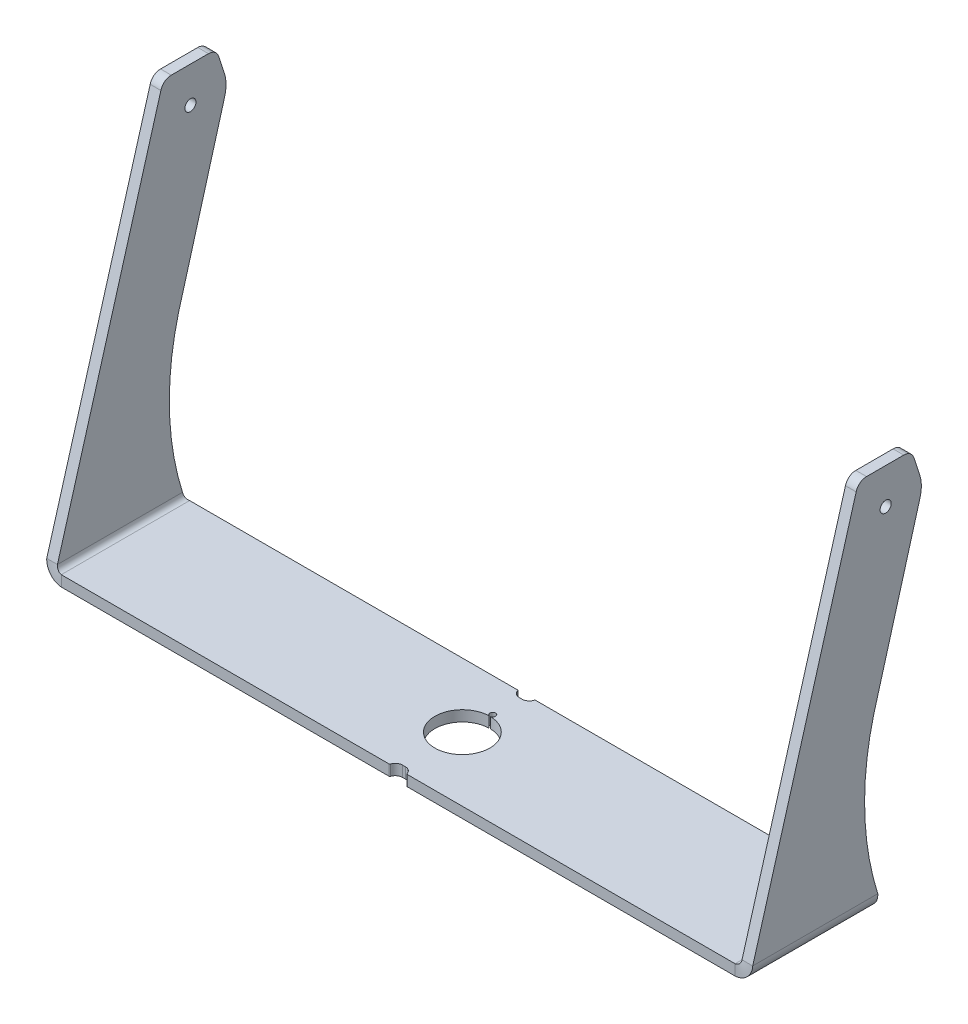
ISO-10303-21;
HEADER;
FILE_DESCRIPTION(('STEP AP214'),'2;1');
FILE_NAME('part.step','',(''),(''),'','','');
FILE_SCHEMA(('AUTOMOTIVE_DESIGN { 1 0 10303 214 1 1 1 1 }'));
ENDSEC;
DATA;
#1=APPLICATION_CONTEXT('core data for automotive mechanical design processes');
#2=APPLICATION_PROTOCOL_DEFINITION('international standard','automotive_design',2000,#1);
#3=PRODUCT_CONTEXT('',#1,'mechanical');
#4=PRODUCT('Part','Part','',(#3));
#5=PRODUCT_RELATED_PRODUCT_CATEGORY('part','',(#4));
#6=PRODUCT_DEFINITION_FORMATION('','',#4);
#7=PRODUCT_DEFINITION_CONTEXT('part definition',#1,'design');
#8=PRODUCT_DEFINITION('design','',#6,#7);
#9=PRODUCT_DEFINITION_SHAPE('','',#8);
#10=(LENGTH_UNIT() NAMED_UNIT(*) SI_UNIT(.MILLI.,.METRE.));
#11=(NAMED_UNIT(*) PLANE_ANGLE_UNIT() SI_UNIT($,.RADIAN.));
#12=(NAMED_UNIT(*) SI_UNIT($,.STERADIAN.) SOLID_ANGLE_UNIT());
#13=UNCERTAINTY_MEASURE_WITH_UNIT(LENGTH_MEASURE(1.E-05),#10,'distance_accuracy_value','');
#14=(GEOMETRIC_REPRESENTATION_CONTEXT(3) GLOBAL_UNCERTAINTY_ASSIGNED_CONTEXT((#13)) GLOBAL_UNIT_ASSIGNED_CONTEXT((#10,
#11,#12)) REPRESENTATION_CONTEXT('',''));
#15=CARTESIAN_POINT('',(0.,0.,0.));
#16=DIRECTION('',(0.,0.,1.));
#17=DIRECTION('',(1.,0.,0.));
#18=AXIS2_PLACEMENT_3D('',#15,#16,#17);
#19=CARTESIAN_POINT('',(-1.27,9.525,58.3716647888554));
#20=DIRECTION('',(0.,1.,0.));
#21=DIRECTION('',(0.,0.,1.));
#22=AXIS2_PLACEMENT_3D('',#19,#20,#21);
#23=PLANE('',#22);
#24=DIRECTION('',(0.,0.,1.));
#25=VECTOR('',#24,1.);
#26=CARTESIAN_POINT('',(-0.761999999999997,9.525,-24.6279944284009));
#27=LINE('',#26,#25);
#28=CARTESIAN_POINT('',(-0.761999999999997,9.525,-24.6279944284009));
#29=VERTEX_POINT('',#28);
#30=CARTESIAN_POINT('',(-0.76199999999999,9.525,-24.4991525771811));
#31=VERTEX_POINT('',#30);
#32=EDGE_CURVE('E592',#29,#31,#27,.T.);
#33=ORIENTED_EDGE('',*,*,#32,.F.);
#34=CARTESIAN_POINT('',(0.,9.525,-27.051));
#35=DIRECTION('',(0.,1.,0.));
#36=DIRECTION('',(0.,0.,1.));
#37=AXIS2_PLACEMENT_3D('',#34,#35,#36);
#38=CIRCLE('',#37,2.54);
#39=CARTESIAN_POINT('',(0.762000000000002,9.525,-24.6279944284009));
#40=VERTEX_POINT('',#39);
#41=EDGE_CURVE('E590',#40,#29,#38,.T.);
#42=ORIENTED_EDGE('',*,*,#41,.F.);
#43=DIRECTION('',(0.,0.,-1.));
#44=VECTOR('',#43,1.);
#45=CARTESIAN_POINT('',(0.762000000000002,9.525,-24.6279944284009));
#46=LINE('',#45,#44);
#47=CARTESIAN_POINT('',(0.762000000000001,9.525,-24.4991525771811));
#48=VERTEX_POINT('',#47);
#49=EDGE_CURVE('E598',#48,#40,#46,.T.);
#50=ORIENTED_EDGE('',*,*,#49,.F.);
#51=CARTESIAN_POINT('',(0.,9.525,0.));
#52=DIRECTION('',(0.,1.,0.));
#53=DIRECTION('',(0.,0.,1.));
#54=AXIS2_PLACEMENT_3D('',#51,#52,#53);
#55=CIRCLE('',#54,24.511);
#56=EDGE_CURVE('E595',#31,#48,#55,.T.);
#57=ORIENTED_EDGE('',*,*,#56,.F.);
#58=EDGE_LOOP('',(#33,#42,#50,#57));
#59=FACE_BOUND('',#58,.T.);
#60=DIRECTION('',(-1.,0.,0.));
#61=VECTOR('',#60,1.);
#62=CARTESIAN_POINT('',(-314.3377,9.525,-57.1499999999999));
#63=LINE('',#62,#61);
#64=CARTESIAN_POINT('',(-8.09975973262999,9.525,-57.1499999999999));
#65=VERTEX_POINT('',#64);
#66=CARTESIAN_POINT('',(-300.0375,9.525,-57.1499999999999));
#67=VERTEX_POINT('',#66);
#68=EDGE_CURVE('E648',#65,#67,#63,.T.);
#69=ORIENTED_EDGE('',*,*,#68,.T.);
#70=DIRECTION('',(0.,0.,1.));
#71=VECTOR('',#70,1.);
#72=CARTESIAN_POINT('',(-300.0375,9.52500000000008,57.1499935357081));
#73=LINE('',#72,#71);
#74=CARTESIAN_POINT('',(-300.0375,9.52500000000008,57.1499935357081));
#75=VERTEX_POINT('',#74);
#76=EDGE_CURVE('E430',#75,#67,#73,.F.);
#77=ORIENTED_EDGE('',*,*,#76,.F.);
#78=DIRECTION('',(1.,0.,0.));
#79=VECTOR('',#78,1.);
#80=CARTESIAN_POINT('',(-314.3377,9.525,57.1499999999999));
#81=LINE('',#80,#79);
#82=CARTESIAN_POINT('',(-8.09975973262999,9.525,57.1499999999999));
#83=VERTEX_POINT('',#82);
#84=EDGE_CURVE('E650',#75,#83,#81,.T.);
#85=ORIENTED_EDGE('',*,*,#84,.T.);
#86=CARTESIAN_POINT('',(-8.09975973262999,9.525,56.388));
#87=DIRECTION('',(0.,1.,0.));
#88=DIRECTION('',(0.,0.,1.));
#89=AXIS2_PLACEMENT_3D('',#86,#87,#88);
#90=CIRCLE('',#89,0.76199999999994);
#91=CARTESIAN_POINT('',(-7.36799976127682,9.525,56.6005355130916));
#92=VERTEX_POINT('',#91);
#93=EDGE_CURVE('E652',#83,#92,#90,.T.);
#94=ORIENTED_EDGE('',*,*,#93,.T.);
#95=CARTESIAN_POINT('',(-1.27,9.525,58.3716647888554));
#96=DIRECTION('',(0.,-1.,0.));
#97=DIRECTION('',(0.,0.,1.));
#98=AXIS2_PLACEMENT_3D('',#95,#96,#97);
#99=CIRCLE('',#98,6.34999999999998);
#100=CARTESIAN_POINT('',(-1.27,9.525,52.0216647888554));
#101=VERTEX_POINT('',#100);
#102=EDGE_CURVE('E623',#92,#101,#99,.T.);
#103=ORIENTED_EDGE('',*,*,#102,.T.);
#104=DIRECTION('',(1.,0.,0.));
#105=VECTOR('',#104,1.);
#106=CARTESIAN_POINT('',(-1.27,9.525,52.0216647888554));
#107=LINE('',#106,#105);
#108=CARTESIAN_POINT('',(1.27,9.525,52.0216647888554));
#109=VERTEX_POINT('',#108);
#110=EDGE_CURVE('E626',#101,#109,#107,.T.);
#111=ORIENTED_EDGE('',*,*,#110,.T.);
#112=CARTESIAN_POINT('',(1.27,9.525,58.3716647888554));
#113=DIRECTION('',(0.,-1.,0.));
#114=DIRECTION('',(0.,0.,1.));
#115=AXIS2_PLACEMENT_3D('',#112,#113,#114);
#116=CIRCLE('',#115,6.34999999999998);
#117=CARTESIAN_POINT('',(7.36799976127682,9.525,56.6005355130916));
#118=VERTEX_POINT('',#117);
#119=EDGE_CURVE('E629',#109,#118,#116,.T.);
#120=ORIENTED_EDGE('',*,*,#119,.T.);
#121=CARTESIAN_POINT('',(8.09975973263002,9.525,56.388));
#122=DIRECTION('',(0.,1.,0.));
#123=DIRECTION('',(0.,0.,1.));
#124=AXIS2_PLACEMENT_3D('',#121,#122,#123);
#125=CIRCLE('',#124,0.761999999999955);
#126=CARTESIAN_POINT('',(8.09975973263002,9.525,57.1499999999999));
#127=VERTEX_POINT('',#126);
#128=EDGE_CURVE('E631',#118,#127,#125,.T.);
#129=ORIENTED_EDGE('',*,*,#128,.T.);
#130=DIRECTION('',(1.,0.,0.));
#131=VECTOR('',#130,1.);
#132=CARTESIAN_POINT('',(8.09975973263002,9.525,57.1499999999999));
#133=LINE('',#132,#131);
#134=CARTESIAN_POINT('',(300.0375,9.525,57.1499999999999));
#135=VERTEX_POINT('',#134);
#136=EDGE_CURVE('E633',#127,#135,#133,.T.);
#137=ORIENTED_EDGE('',*,*,#136,.T.);
#138=DIRECTION('',(0.,0.,-1.));
#139=VECTOR('',#138,1.);
#140=CARTESIAN_POINT('',(300.0375,9.52500000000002,-57.1500064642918));
#141=LINE('',#140,#139);
#142=CARTESIAN_POINT('',(300.0375,9.52500000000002,-57.1500064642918));
#143=VERTEX_POINT('',#142);
#144=EDGE_CURVE('E588',#143,#135,#141,.F.);
#145=ORIENTED_EDGE('',*,*,#144,.F.);
#146=DIRECTION('',(-1.,0.,0.));
#147=VECTOR('',#146,1.);
#148=CARTESIAN_POINT('',(8.09975973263,9.525,-57.1499999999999));
#149=LINE('',#148,#147);
#150=CARTESIAN_POINT('',(8.09975973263,9.525,-57.1499999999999));
#151=VERTEX_POINT('',#150);
#152=EDGE_CURVE('E636',#143,#151,#149,.T.);
#153=ORIENTED_EDGE('',*,*,#152,.T.);
#154=CARTESIAN_POINT('',(8.09975973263,9.525,-56.388));
#155=DIRECTION('',(0.,1.,0.));
#156=DIRECTION('',(0.,0.,-1.));
#157=AXIS2_PLACEMENT_3D('',#154,#155,#156);
#158=CIRCLE('',#157,0.761999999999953);
#159=CARTESIAN_POINT('',(7.36799976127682,9.525,-56.6005355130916));
#160=VERTEX_POINT('',#159);
#161=EDGE_CURVE('E638',#151,#160,#158,.T.);
#162=ORIENTED_EDGE('',*,*,#161,.T.);
#163=CARTESIAN_POINT('',(1.27,9.525,-58.3716647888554));
#164=DIRECTION('',(0.,-1.,0.));
#165=DIRECTION('',(0.,0.,-1.));
#166=AXIS2_PLACEMENT_3D('',#163,#164,#165);
#167=CIRCLE('',#166,6.34999999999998);
#168=CARTESIAN_POINT('',(1.27,9.525,-52.0216647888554));
#169=VERTEX_POINT('',#168);
#170=EDGE_CURVE('E640',#160,#169,#167,.T.);
#171=ORIENTED_EDGE('',*,*,#170,.T.);
#172=DIRECTION('',(-1.,0.,0.));
#173=VECTOR('',#172,1.);
#174=CARTESIAN_POINT('',(-1.27,9.525,-52.0216647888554));
#175=LINE('',#174,#173);
#176=CARTESIAN_POINT('',(-1.27,9.525,-52.0216647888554));
#177=VERTEX_POINT('',#176);
#178=EDGE_CURVE('E642',#169,#177,#175,.T.);
#179=ORIENTED_EDGE('',*,*,#178,.T.);
#180=CARTESIAN_POINT('',(-1.27,9.525,-58.3716647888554));
#181=DIRECTION('',(0.,-1.,0.));
#182=DIRECTION('',(0.,0.,-1.));
#183=AXIS2_PLACEMENT_3D('',#180,#181,#182);
#184=CIRCLE('',#183,6.34999999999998);
#185=CARTESIAN_POINT('',(-7.36799976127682,9.525,-56.6005355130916));
#186=VERTEX_POINT('',#185);
#187=EDGE_CURVE('E644',#177,#186,#184,.T.);
#188=ORIENTED_EDGE('',*,*,#187,.T.);
#189=CARTESIAN_POINT('',(-8.09975973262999,9.525,-56.388));
#190=DIRECTION('',(0.,1.,0.));
#191=DIRECTION('',(0.,0.,-1.));
#192=AXIS2_PLACEMENT_3D('',#189,#190,#191);
#193=CIRCLE('',#192,0.761999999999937);
#194=EDGE_CURVE('E646',#186,#65,#193,.T.);
#195=ORIENTED_EDGE('',*,*,#194,.T.);
#196=EDGE_LOOP('',(#69,#77,#85,#94,#103,#111,#120,#129,#137,#145,#153,#162,#171,#179,#188,#195));
#197=FACE_BOUND('',#196,.T.);
#198=ADVANCED_FACE('F115',(#59,#197),#23,.T.);
#199=CARTESIAN_POINT('',(-1.27,0.,58.3716647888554));
#200=DIRECTION('',(0.,1.,0.));
#201=DIRECTION('',(0.,0.,1.));
#202=AXIS2_PLACEMENT_3D('',#199,#200,#201);
#203=PLANE('',#202);
#204=CARTESIAN_POINT('',(0.,0.,-27.051));
#205=DIRECTION('',(0.,1.,0.));
#206=DIRECTION('',(0.,0.,1.));
#207=AXIS2_PLACEMENT_3D('',#204,#205,#206);
#208=CIRCLE('',#207,2.54);
#209=CARTESIAN_POINT('',(0.762000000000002,0.,-24.6279944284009));
#210=VERTEX_POINT('',#209);
#211=CARTESIAN_POINT('',(-0.761999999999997,0.,-24.6279944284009));
#212=VERTEX_POINT('',#211);
#213=EDGE_CURVE('E601',#210,#212,#208,.T.);
#214=ORIENTED_EDGE('',*,*,#213,.T.);
#215=DIRECTION('',(0.,0.,1.));
#216=VECTOR('',#215,1.);
#217=CARTESIAN_POINT('',(-0.761999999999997,0.,-24.6279944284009));
#218=LINE('',#217,#216);
#219=CARTESIAN_POINT('',(-0.76199999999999,0.,-24.4991525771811));
#220=VERTEX_POINT('',#219);
#221=EDGE_CURVE('E604',#212,#220,#218,.T.);
#222=ORIENTED_EDGE('',*,*,#221,.T.);
#223=CARTESIAN_POINT('',(0.,0.,0.));
#224=DIRECTION('',(0.,1.,0.));
#225=DIRECTION('',(0.,0.,1.));
#226=AXIS2_PLACEMENT_3D('',#223,#224,#225);
#227=CIRCLE('',#226,24.511);
#228=CARTESIAN_POINT('',(0.762000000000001,0.,-24.4991525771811));
#229=VERTEX_POINT('',#228);
#230=EDGE_CURVE('E608',#220,#229,#227,.T.);
#231=ORIENTED_EDGE('',*,*,#230,.T.);
#232=DIRECTION('',(0.,0.,-1.));
#233=VECTOR('',#232,1.);
#234=CARTESIAN_POINT('',(0.762000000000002,0.,-24.6279944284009));
#235=LINE('',#234,#233);
#236=EDGE_CURVE('E593',#229,#210,#235,.T.);
#237=ORIENTED_EDGE('',*,*,#236,.T.);
#238=EDGE_LOOP('',(#214,#222,#231,#237));
#239=FACE_BOUND('',#238,.T.);
#240=DIRECTION('',(0.,0.,1.));
#241=VECTOR('',#240,1.);
#242=CARTESIAN_POINT('',(-300.0375,0.,57.1499935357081));
#243=LINE('',#242,#241);
#244=CARTESIAN_POINT('',(-300.0375,0.,57.1499935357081));
#245=VERTEX_POINT('',#244);
#246=CARTESIAN_POINT('',(-300.0375,0.,-57.1499999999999));
#247=VERTEX_POINT('',#246);
#248=EDGE_CURVE('E139',#245,#247,#243,.F.);
#249=ORIENTED_EDGE('',*,*,#248,.T.);
#250=DIRECTION('',(-1.,0.,0.));
#251=VECTOR('',#250,1.);
#252=CARTESIAN_POINT('',(-314.3377,0.,-57.1499999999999));
#253=LINE('',#252,#251);
#254=CARTESIAN_POINT('',(-8.09975973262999,0.,-57.1499999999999));
#255=VERTEX_POINT('',#254);
#256=EDGE_CURVE('E678',#255,#247,#253,.T.);
#257=ORIENTED_EDGE('',*,*,#256,.F.);
#258=CARTESIAN_POINT('',(-8.09975973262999,0.,-56.388));
#259=DIRECTION('',(0.,1.,0.));
#260=DIRECTION('',(0.,0.,-1.));
#261=AXIS2_PLACEMENT_3D('',#258,#259,#260);
#262=CIRCLE('',#261,0.761999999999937);
#263=CARTESIAN_POINT('',(-7.36799976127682,0.,-56.6005355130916));
#264=VERTEX_POINT('',#263);
#265=EDGE_CURVE('E676',#264,#255,#262,.T.);
#266=ORIENTED_EDGE('',*,*,#265,.F.);
#267=CARTESIAN_POINT('',(-1.27,0.,-58.3716647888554));
#268=DIRECTION('',(0.,-1.,0.));
#269=DIRECTION('',(0.,0.,-1.));
#270=AXIS2_PLACEMENT_3D('',#267,#268,#269);
#271=CIRCLE('',#270,6.34999999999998);
#272=CARTESIAN_POINT('',(-1.27,0.,-52.0216647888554));
#273=VERTEX_POINT('',#272);
#274=EDGE_CURVE('E674',#273,#264,#271,.T.);
#275=ORIENTED_EDGE('',*,*,#274,.F.);
#276=DIRECTION('',(-1.,0.,0.));
#277=VECTOR('',#276,1.);
#278=CARTESIAN_POINT('',(-1.27,0.,-52.0216647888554));
#279=LINE('',#278,#277);
#280=CARTESIAN_POINT('',(1.27,0.,-52.0216647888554));
#281=VERTEX_POINT('',#280);
#282=EDGE_CURVE('E672',#281,#273,#279,.T.);
#283=ORIENTED_EDGE('',*,*,#282,.F.);
#284=CARTESIAN_POINT('',(1.27,0.,-58.3716647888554));
#285=DIRECTION('',(0.,-1.,0.));
#286=DIRECTION('',(0.,0.,-1.));
#287=AXIS2_PLACEMENT_3D('',#284,#285,#286);
#288=CIRCLE('',#287,6.34999999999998);
#289=CARTESIAN_POINT('',(7.36799976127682,0.,-56.6005355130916));
#290=VERTEX_POINT('',#289);
#291=EDGE_CURVE('E670',#290,#281,#288,.T.);
#292=ORIENTED_EDGE('',*,*,#291,.F.);
#293=CARTESIAN_POINT('',(8.09975973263,0.,-56.388));
#294=DIRECTION('',(0.,1.,0.));
#295=DIRECTION('',(0.,0.,-1.));
#296=AXIS2_PLACEMENT_3D('',#293,#294,#295);
#297=CIRCLE('',#296,0.761999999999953);
#298=CARTESIAN_POINT('',(8.09975973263,0.,-57.1499999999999));
#299=VERTEX_POINT('',#298);
#300=EDGE_CURVE('E668',#299,#290,#297,.T.);
#301=ORIENTED_EDGE('',*,*,#300,.F.);
#302=DIRECTION('',(-1.,0.,0.));
#303=VECTOR('',#302,1.);
#304=CARTESIAN_POINT('',(8.09975973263,0.,-57.1499999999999));
#305=LINE('',#304,#303);
#306=CARTESIAN_POINT('',(300.0375,0.,-57.1500064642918));
#307=VERTEX_POINT('',#306);
#308=EDGE_CURVE('E666',#307,#299,#305,.T.);
#309=ORIENTED_EDGE('',*,*,#308,.F.);
#310=DIRECTION('',(0.,0.,-1.));
#311=VECTOR('',#310,1.);
#312=CARTESIAN_POINT('',(300.0375,0.,-57.1500064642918));
#313=LINE('',#312,#311);
#314=CARTESIAN_POINT('',(300.0375,0.,57.1499999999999));
#315=VERTEX_POINT('',#314);
#316=EDGE_CURVE('E556',#307,#315,#313,.F.);
#317=ORIENTED_EDGE('',*,*,#316,.T.);
#318=DIRECTION('',(1.,0.,0.));
#319=VECTOR('',#318,1.);
#320=CARTESIAN_POINT('',(8.09975973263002,0.,57.1499999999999));
#321=LINE('',#320,#319);
#322=CARTESIAN_POINT('',(8.09975973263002,0.,57.1499999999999));
#323=VERTEX_POINT('',#322);
#324=EDGE_CURVE('E663',#323,#315,#321,.T.);
#325=ORIENTED_EDGE('',*,*,#324,.F.);
#326=CARTESIAN_POINT('',(8.09975973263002,0.,56.388));
#327=DIRECTION('',(0.,1.,0.));
#328=DIRECTION('',(0.,0.,1.));
#329=AXIS2_PLACEMENT_3D('',#326,#327,#328);
#330=CIRCLE('',#329,0.761999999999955);
#331=CARTESIAN_POINT('',(7.36799976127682,0.,56.6005355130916));
#332=VERTEX_POINT('',#331);
#333=EDGE_CURVE('E661',#332,#323,#330,.T.);
#334=ORIENTED_EDGE('',*,*,#333,.F.);
#335=CARTESIAN_POINT('',(1.27,0.,58.3716647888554));
#336=DIRECTION('',(0.,-1.,0.));
#337=DIRECTION('',(0.,0.,1.));
#338=AXIS2_PLACEMENT_3D('',#335,#336,#337);
#339=CIRCLE('',#338,6.34999999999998);
#340=CARTESIAN_POINT('',(1.27,0.,52.0216647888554));
#341=VERTEX_POINT('',#340);
#342=EDGE_CURVE('E659',#341,#332,#339,.T.);
#343=ORIENTED_EDGE('',*,*,#342,.F.);
#344=DIRECTION('',(1.,0.,0.));
#345=VECTOR('',#344,1.);
#346=CARTESIAN_POINT('',(-1.27,0.,52.0216647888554));
#347=LINE('',#346,#345);
#348=CARTESIAN_POINT('',(-1.27,0.,52.0216647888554));
#349=VERTEX_POINT('',#348);
#350=EDGE_CURVE('E657',#349,#341,#347,.T.);
#351=ORIENTED_EDGE('',*,*,#350,.F.);
#352=CARTESIAN_POINT('',(-1.27,0.,58.3716647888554));
#353=DIRECTION('',(0.,-1.,0.));
#354=DIRECTION('',(0.,0.,1.));
#355=AXIS2_PLACEMENT_3D('',#352,#353,#354);
#356=CIRCLE('',#355,6.34999999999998);
#357=CARTESIAN_POINT('',(-7.36799976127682,0.,56.6005355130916));
#358=VERTEX_POINT('',#357);
#359=EDGE_CURVE('E622',#358,#349,#356,.T.);
#360=ORIENTED_EDGE('',*,*,#359,.F.);
#361=CARTESIAN_POINT('',(-8.09975973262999,0.,56.388));
#362=DIRECTION('',(0.,1.,0.));
#363=DIRECTION('',(0.,0.,1.));
#364=AXIS2_PLACEMENT_3D('',#361,#362,#363);
#365=CIRCLE('',#364,0.76199999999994);
#366=CARTESIAN_POINT('',(-8.09975973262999,0.,57.1499999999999));
#367=VERTEX_POINT('',#366);
#368=EDGE_CURVE('E627',#367,#358,#365,.T.);
#369=ORIENTED_EDGE('',*,*,#368,.F.);
#370=DIRECTION('',(1.,0.,0.));
#371=VECTOR('',#370,1.);
#372=CARTESIAN_POINT('',(-314.3377,0.,57.1499999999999));
#373=LINE('',#372,#371);
#374=EDGE_CURVE('E680',#245,#367,#373,.T.);
#375=ORIENTED_EDGE('',*,*,#374,.F.);
#376=EDGE_LOOP('',(#249,#257,#266,#275,#283,#292,#301,#309,#317,#325,#334,#343,#351,#360,#369,#375));
#377=FACE_BOUND('',#376,.T.);
#378=ADVANCED_FACE('F721',(#239,#377),#203,.F.);
#379=CARTESIAN_POINT('',(-314.3377,9.525,-57.1499999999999));
#380=DIRECTION('',(0.,0.,1.));
#381=DIRECTION('',(1.,0.,0.));
#382=AXIS2_PLACEMENT_3D('',#379,#380,#381);
#383=PLANE('',#382);
#384=DIRECTION('',(0.,-1.,0.));
#385=VECTOR('',#384,1.);
#386=CARTESIAN_POINT('',(-300.0375,9.52500000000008,-57.1500064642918));
#387=LINE('',#386,#385);
#388=EDGE_CURVE('E131',#67,#247,#387,.T.);
#389=ORIENTED_EDGE('',*,*,#388,.F.);
#390=ORIENTED_EDGE('',*,*,#68,.F.);
#391=DIRECTION('',(0.,-1.,0.));
#392=VECTOR('',#391,1.);
#393=CARTESIAN_POINT('',(-8.09975973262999,9.525,-57.1499999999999));
#394=LINE('',#393,#392);
#395=EDGE_CURVE('E688',#65,#255,#394,.T.);
#396=ORIENTED_EDGE('',*,*,#395,.T.);
#397=ORIENTED_EDGE('',*,*,#256,.T.);
#398=EDGE_LOOP('',(#389,#390,#396,#397));
#399=FACE_BOUND('',#398,.T.);
#400=ADVANCED_FACE('F954',(#399),#383,.F.);
#401=CARTESIAN_POINT('',(-314.3377,9.525,57.1499999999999));
#402=DIRECTION('',(0.,0.,-1.));
#403=DIRECTION('',(-1.,0.,0.));
#404=AXIS2_PLACEMENT_3D('',#401,#402,#403);
#405=PLANE('',#404);
#406=DIRECTION('',(0.,-1.,0.));
#407=VECTOR('',#406,1.);
#408=CARTESIAN_POINT('',(-300.0375,9.52500000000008,57.1499935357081));
#409=LINE('',#408,#407);
#410=EDGE_CURVE('E437',#75,#245,#409,.T.);
#411=ORIENTED_EDGE('',*,*,#410,.T.);
#412=ORIENTED_EDGE('',*,*,#374,.T.);
#413=DIRECTION('',(0.,-1.,0.));
#414=VECTOR('',#413,1.);
#415=CARTESIAN_POINT('',(-8.09975973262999,9.525,57.1499999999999));
#416=LINE('',#415,#414);
#417=EDGE_CURVE('E685',#83,#367,#416,.T.);
#418=ORIENTED_EDGE('',*,*,#417,.F.);
#419=ORIENTED_EDGE('',*,*,#84,.F.);
#420=EDGE_LOOP('',(#411,#412,#418,#419));
#421=FACE_BOUND('',#420,.T.);
#422=ADVANCED_FACE('F966',(#421),#405,.F.);
#423=CARTESIAN_POINT('',(8.09975973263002,9.525,57.1499999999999));
#424=DIRECTION('',(0.,0.,-1.));
#425=DIRECTION('',(-1.,0.,0.));
#426=AXIS2_PLACEMENT_3D('',#423,#424,#425);
#427=PLANE('',#426);
#428=DIRECTION('',(0.,-1.,0.));
#429=VECTOR('',#428,1.);
#430=CARTESIAN_POINT('',(300.0375,9.52500000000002,57.1499935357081));
#431=LINE('',#430,#429);
#432=EDGE_CURVE('E605',#135,#315,#431,.T.);
#433=ORIENTED_EDGE('',*,*,#432,.F.);
#434=ORIENTED_EDGE('',*,*,#136,.F.);
#435=DIRECTION('',(0.,-1.,0.));
#436=VECTOR('',#435,1.);
#437=CARTESIAN_POINT('',(8.09975973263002,9.525,57.1499999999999));
#438=LINE('',#437,#436);
#439=EDGE_CURVE('E706',#127,#323,#438,.T.);
#440=ORIENTED_EDGE('',*,*,#439,.T.);
#441=ORIENTED_EDGE('',*,*,#324,.T.);
#442=EDGE_LOOP('',(#433,#434,#440,#441));
#443=FACE_BOUND('',#442,.T.);
#444=ADVANCED_FACE('F730',(#443),#427,.F.);
#445=CARTESIAN_POINT('',(8.09975973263,9.525,-57.1499999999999));
#446=DIRECTION('',(0.,0.,1.));
#447=DIRECTION('',(1.,0.,0.));
#448=AXIS2_PLACEMENT_3D('',#445,#446,#447);
#449=PLANE('',#448);
#450=DIRECTION('',(0.,-1.,0.));
#451=VECTOR('',#450,1.);
#452=CARTESIAN_POINT('',(300.0375,9.52500000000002,-57.1500064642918));
#453=LINE('',#452,#451);
#454=EDGE_CURVE('E756',#143,#307,#453,.T.);
#455=ORIENTED_EDGE('',*,*,#454,.T.);
#456=ORIENTED_EDGE('',*,*,#308,.T.);
#457=DIRECTION('',(0.,-1.,0.));
#458=VECTOR('',#457,1.);
#459=CARTESIAN_POINT('',(8.09975973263,9.525,-57.1499999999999));
#460=LINE('',#459,#458);
#461=EDGE_CURVE('E703',#151,#299,#460,.T.);
#462=ORIENTED_EDGE('',*,*,#461,.F.);
#463=ORIENTED_EDGE('',*,*,#152,.F.);
#464=EDGE_LOOP('',(#455,#456,#462,#463));
#465=FACE_BOUND('',#464,.T.);
#466=ADVANCED_FACE('F760',(#465),#449,.F.);
#467=CARTESIAN_POINT('',(-1.27,9.525,58.3716647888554));
#468=DIRECTION('',(0.,-1.,0.));
#469=DIRECTION('',(0.,0.,-1.));
#470=AXIS2_PLACEMENT_3D('',#467,#468,#469);
#471=CYLINDRICAL_SURFACE('',#470,6.34999999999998);
#472=ORIENTED_EDGE('',*,*,#359,.T.);
#473=DIRECTION('',(0.,-1.,0.));
#474=VECTOR('',#473,1.);
#475=CARTESIAN_POINT('',(-1.27,9.525,52.0216647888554));
#476=LINE('',#475,#474);
#477=EDGE_CURVE('E13',#101,#349,#476,.T.);
#478=ORIENTED_EDGE('',*,*,#477,.F.);
#479=ORIENTED_EDGE('',*,*,#102,.F.);
#480=DIRECTION('',(0.,-1.,0.));
#481=VECTOR('',#480,1.);
#482=CARTESIAN_POINT('',(-7.36799976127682,9.525,56.6005355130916));
#483=LINE('',#482,#481);
#484=EDGE_CURVE('E654',#92,#358,#483,.T.);
#485=ORIENTED_EDGE('',*,*,#484,.T.);
#486=EDGE_LOOP('',(#472,#478,#479,#485));
#487=FACE_BOUND('',#486,.T.);
#488=ADVANCED_FACE('F117',(#487),#471,.F.);
#489=CARTESIAN_POINT('',(-1.27,9.525,52.0216647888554));
#490=DIRECTION('',(0.,0.,-1.));
#491=DIRECTION('',(-1.,0.,0.));
#492=AXIS2_PLACEMENT_3D('',#489,#490,#491);
#493=PLANE('',#492);
#494=ORIENTED_EDGE('',*,*,#350,.T.);
#495=DIRECTION('',(0.,-1.,0.));
#496=VECTOR('',#495,1.);
#497=CARTESIAN_POINT('',(1.27,9.525,52.0216647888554));
#498=LINE('',#497,#496);
#499=EDGE_CURVE('E124',#109,#341,#498,.T.);
#500=ORIENTED_EDGE('',*,*,#499,.F.);
#501=ORIENTED_EDGE('',*,*,#110,.F.);
#502=ORIENTED_EDGE('',*,*,#477,.T.);
#503=EDGE_LOOP('',(#494,#500,#501,#502));
#504=FACE_BOUND('',#503,.T.);
#505=ADVANCED_FACE('F989',(#504),#493,.F.);
#506=CARTESIAN_POINT('',(1.27,9.525,58.3716647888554));
#507=DIRECTION('',(0.,-1.,0.));
#508=DIRECTION('',(0.,0.,-1.));
#509=AXIS2_PLACEMENT_3D('',#506,#507,#508);
#510=CYLINDRICAL_SURFACE('',#509,6.34999999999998);
#511=ORIENTED_EDGE('',*,*,#342,.T.);
#512=DIRECTION('',(0.,-1.,0.));
#513=VECTOR('',#512,1.);
#514=CARTESIAN_POINT('',(7.36799976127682,9.525,56.6005355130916));
#515=LINE('',#514,#513);
#516=EDGE_CURVE('E709',#118,#332,#515,.T.);
#517=ORIENTED_EDGE('',*,*,#516,.F.);
#518=ORIENTED_EDGE('',*,*,#119,.F.);
#519=ORIENTED_EDGE('',*,*,#499,.T.);
#520=EDGE_LOOP('',(#511,#517,#518,#519));
#521=FACE_BOUND('',#520,.T.);
#522=ADVANCED_FACE('F717',(#521),#510,.F.);
#523=CARTESIAN_POINT('',(8.09975973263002,9.525,56.388));
#524=DIRECTION('',(0.,-1.,0.));
#525=DIRECTION('',(0.,0.,-1.));
#526=AXIS2_PLACEMENT_3D('',#523,#524,#525);
#527=CYLINDRICAL_SURFACE('',#526,0.761999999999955);
#528=ORIENTED_EDGE('',*,*,#333,.T.);
#529=ORIENTED_EDGE('',*,*,#439,.F.);
#530=ORIENTED_EDGE('',*,*,#128,.F.);
#531=ORIENTED_EDGE('',*,*,#516,.T.);
#532=EDGE_LOOP('',(#528,#529,#530,#531));
#533=FACE_BOUND('',#532,.T.);
#534=ADVANCED_FACE('F726',(#533),#527,.T.);
#535=CARTESIAN_POINT('',(8.09975973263,9.525,-56.388));
#536=DIRECTION('',(0.,-1.,0.));
#537=DIRECTION('',(0.,0.,-1.));
#538=AXIS2_PLACEMENT_3D('',#535,#536,#537);
#539=CYLINDRICAL_SURFACE('',#538,0.761999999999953);
#540=ORIENTED_EDGE('',*,*,#300,.T.);
#541=DIRECTION('',(0.,-1.,0.));
#542=VECTOR('',#541,1.);
#543=CARTESIAN_POINT('',(7.36799976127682,9.525,-56.6005355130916));
#544=LINE('',#543,#542);
#545=EDGE_CURVE('E700',#160,#290,#544,.T.);
#546=ORIENTED_EDGE('',*,*,#545,.F.);
#547=ORIENTED_EDGE('',*,*,#161,.F.);
#548=ORIENTED_EDGE('',*,*,#461,.T.);
#549=EDGE_LOOP('',(#540,#546,#547,#548));
#550=FACE_BOUND('',#549,.T.);
#551=ADVANCED_FACE('F845',(#550),#539,.T.);
#552=CARTESIAN_POINT('',(1.27,9.525,-58.3716647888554));
#553=DIRECTION('',(0.,-1.,0.));
#554=DIRECTION('',(0.,0.,-1.));
#555=AXIS2_PLACEMENT_3D('',#552,#553,#554);
#556=CYLINDRICAL_SURFACE('',#555,6.34999999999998);
#557=ORIENTED_EDGE('',*,*,#291,.T.);
#558=DIRECTION('',(0.,-1.,0.));
#559=VECTOR('',#558,1.);
#560=CARTESIAN_POINT('',(1.27,9.525,-52.0216647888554));
#561=LINE('',#560,#559);
#562=EDGE_CURVE('E697',#169,#281,#561,.T.);
#563=ORIENTED_EDGE('',*,*,#562,.F.);
#564=ORIENTED_EDGE('',*,*,#170,.F.);
#565=ORIENTED_EDGE('',*,*,#545,.T.);
#566=EDGE_LOOP('',(#557,#563,#564,#565));
#567=FACE_BOUND('',#566,.T.);
#568=ADVANCED_FACE('F849',(#567),#556,.F.);
#569=CARTESIAN_POINT('',(-1.27,9.525,-52.0216647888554));
#570=DIRECTION('',(0.,0.,1.));
#571=DIRECTION('',(1.,0.,0.));
#572=AXIS2_PLACEMENT_3D('',#569,#570,#571);
#573=PLANE('',#572);
#574=ORIENTED_EDGE('',*,*,#282,.T.);
#575=DIRECTION('',(0.,-1.,0.));
#576=VECTOR('',#575,1.);
#577=CARTESIAN_POINT('',(-1.27,9.525,-52.0216647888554));
#578=LINE('',#577,#576);
#579=EDGE_CURVE('E694',#177,#273,#578,.T.);
#580=ORIENTED_EDGE('',*,*,#579,.F.);
#581=ORIENTED_EDGE('',*,*,#178,.F.);
#582=ORIENTED_EDGE('',*,*,#562,.T.);
#583=EDGE_LOOP('',(#574,#580,#581,#582));
#584=FACE_BOUND('',#583,.T.);
#585=ADVANCED_FACE('F856',(#584),#573,.F.);
#586=CARTESIAN_POINT('',(-1.27,9.525,-58.3716647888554));
#587=DIRECTION('',(0.,-1.,0.));
#588=DIRECTION('',(0.,0.,-1.));
#589=AXIS2_PLACEMENT_3D('',#586,#587,#588);
#590=CYLINDRICAL_SURFACE('',#589,6.34999999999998);
#591=ORIENTED_EDGE('',*,*,#274,.T.);
#592=DIRECTION('',(0.,-1.,0.));
#593=VECTOR('',#592,1.);
#594=CARTESIAN_POINT('',(-7.36799976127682,9.525,-56.6005355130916));
#595=LINE('',#594,#593);
#596=EDGE_CURVE('E691',#186,#264,#595,.T.);
#597=ORIENTED_EDGE('',*,*,#596,.F.);
#598=ORIENTED_EDGE('',*,*,#187,.F.);
#599=ORIENTED_EDGE('',*,*,#579,.T.);
#600=EDGE_LOOP('',(#591,#597,#598,#599));
#601=FACE_BOUND('',#600,.T.);
#602=ADVANCED_FACE('F859',(#601),#590,.F.);
#603=CARTESIAN_POINT('',(-8.09975973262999,9.525,-56.388));
#604=DIRECTION('',(0.,-1.,0.));
#605=DIRECTION('',(0.,0.,-1.));
#606=AXIS2_PLACEMENT_3D('',#603,#604,#605);
#607=CYLINDRICAL_SURFACE('',#606,0.761999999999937);
#608=ORIENTED_EDGE('',*,*,#265,.T.);
#609=ORIENTED_EDGE('',*,*,#395,.F.);
#610=ORIENTED_EDGE('',*,*,#194,.F.);
#611=ORIENTED_EDGE('',*,*,#596,.T.);
#612=EDGE_LOOP('',(#608,#609,#610,#611));
#613=FACE_BOUND('',#612,.T.);
#614=ADVANCED_FACE('F864',(#613),#607,.T.);
#615=CARTESIAN_POINT('',(-8.09975973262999,9.525,56.388));
#616=DIRECTION('',(0.,-1.,0.));
#617=DIRECTION('',(0.,0.,-1.));
#618=AXIS2_PLACEMENT_3D('',#615,#616,#617);
#619=CYLINDRICAL_SURFACE('',#618,0.76199999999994);
#620=ORIENTED_EDGE('',*,*,#368,.T.);
#621=ORIENTED_EDGE('',*,*,#484,.F.);
#622=ORIENTED_EDGE('',*,*,#93,.F.);
#623=ORIENTED_EDGE('',*,*,#417,.T.);
#624=EDGE_LOOP('',(#620,#621,#622,#623));
#625=FACE_BOUND('',#624,.T.);
#626=ADVANCED_FACE('F962',(#625),#619,.T.);
#627=CARTESIAN_POINT('',(0.,9.525,-27.051));
#628=DIRECTION('',(0.,-1.,0.));
#629=DIRECTION('',(0.,0.,-1.));
#630=AXIS2_PLACEMENT_3D('',#627,#628,#629);
#631=CYLINDRICAL_SURFACE('',#630,2.54);
#632=ORIENTED_EDGE('',*,*,#213,.F.);
#633=DIRECTION('',(0.,-1.,0.));
#634=VECTOR('',#633,1.);
#635=CARTESIAN_POINT('',(0.762000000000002,9.525,-24.6279944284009));
#636=LINE('',#635,#634);
#637=EDGE_CURVE('E600',#40,#210,#636,.T.);
#638=ORIENTED_EDGE('',*,*,#637,.F.);
#639=ORIENTED_EDGE('',*,*,#41,.T.);
#640=DIRECTION('',(0.,-1.,0.));
#641=VECTOR('',#640,1.);
#642=CARTESIAN_POINT('',(-0.761999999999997,9.525,-24.6279944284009));
#643=LINE('',#642,#641);
#644=EDGE_CURVE('E619',#29,#212,#643,.T.);
#645=ORIENTED_EDGE('',*,*,#644,.T.);
#646=EDGE_LOOP('',(#632,#638,#639,#645));
#647=FACE_BOUND('',#646,.T.);
#648=ADVANCED_FACE('F959',(#647),#631,.F.);
#649=CARTESIAN_POINT('',(-0.761999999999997,9.525,-24.6279944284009));
#650=DIRECTION('',(1.,0.,0.));
#651=DIRECTION('',(0.,0.,-1.));
#652=AXIS2_PLACEMENT_3D('',#649,#650,#651);
#653=PLANE('',#652);
#654=ORIENTED_EDGE('',*,*,#221,.F.);
#655=ORIENTED_EDGE('',*,*,#644,.F.);
#656=ORIENTED_EDGE('',*,*,#32,.T.);
#657=DIRECTION('',(0.,-1.,0.));
#658=VECTOR('',#657,1.);
#659=CARTESIAN_POINT('',(-0.76199999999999,9.525,-24.4991525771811));
#660=LINE('',#659,#658);
#661=EDGE_CURVE('E617',#31,#220,#660,.T.);
#662=ORIENTED_EDGE('',*,*,#661,.T.);
#663=EDGE_LOOP('',(#654,#655,#656,#662));
#664=FACE_BOUND('',#663,.T.);
#665=ADVANCED_FACE('F1138',(#664),#653,.T.);
#666=CARTESIAN_POINT('',(0.,9.525,0.));
#667=DIRECTION('',(0.,-1.,0.));
#668=DIRECTION('',(0.,0.,-1.));
#669=AXIS2_PLACEMENT_3D('',#666,#667,#668);
#670=CYLINDRICAL_SURFACE('',#669,24.511);
#671=ORIENTED_EDGE('',*,*,#230,.F.);
#672=ORIENTED_EDGE('',*,*,#661,.F.);
#673=ORIENTED_EDGE('',*,*,#56,.T.);
#674=DIRECTION('',(0.,-1.,0.));
#675=VECTOR('',#674,1.);
#676=CARTESIAN_POINT('',(0.762000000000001,9.525,-24.4991525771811));
#677=LINE('',#676,#675);
#678=EDGE_CURVE('E615',#48,#229,#677,.T.);
#679=ORIENTED_EDGE('',*,*,#678,.T.);
#680=EDGE_LOOP('',(#671,#672,#673,#679));
#681=FACE_BOUND('',#680,.T.);
#682=ADVANCED_FACE('F1131',(#681),#670,.F.);
#683=CARTESIAN_POINT('',(0.762000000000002,9.525,-24.6279944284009));
#684=DIRECTION('',(-1.,0.,0.));
#685=DIRECTION('',(0.,0.,1.));
#686=AXIS2_PLACEMENT_3D('',#683,#684,#685);
#687=PLANE('',#686);
#688=ORIENTED_EDGE('',*,*,#236,.F.);
#689=ORIENTED_EDGE('',*,*,#678,.F.);
#690=ORIENTED_EDGE('',*,*,#49,.T.);
#691=ORIENTED_EDGE('',*,*,#637,.T.);
#692=EDGE_LOOP('',(#688,#689,#690,#691));
#693=FACE_BOUND('',#692,.T.);
#694=ADVANCED_FACE('F573',(#693),#687,.T.);
#695=CARTESIAN_POINT('',(300.0375,-0.0952499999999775,57.1499935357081));
#696=CARTESIAN_POINT('',(301.92219850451,-0.0952499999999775,57.0352418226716));
#697=CARTESIAN_POINT('',(303.8054785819,0.27942503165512,56.9205313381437));
#698=CARTESIAN_POINT('',(307.28732185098,1.72165173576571,56.6910691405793));
#699=CARTESIAN_POINT('',(308.884176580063,2.78863595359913,56.5763380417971));
#700=CARTESIAN_POINT('',(311.549064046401,5.45352341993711,56.3468758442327));
#701=CARTESIAN_POINT('',(312.616048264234,7.05037814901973,56.2321447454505));
#702=CARTESIAN_POINT('',(314.058274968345,10.5322214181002,56.0026825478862));
#703=CARTESIAN_POINT('',(314.43295,12.4155014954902,55.8879720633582));
#704=CARTESIAN_POINT('',(314.43295,14.3001999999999,55.7732203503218));
#705=CARTESIAN_POINT('',(300.0375,0.,57.1499935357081));
#706=CARTESIAN_POINT('',(301.909728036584,0.,57.0352418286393));
#707=CARTESIAN_POINT('',(303.780547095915,0.372195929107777,56.9205313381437));
#708=CARTESIAN_POINT('',(307.2393521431,1.80487988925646,56.6910691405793));
#709=CARTESIAN_POINT('',(308.825641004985,2.86480422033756,56.5763380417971));
#710=CARTESIAN_POINT('',(311.472895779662,5.51205899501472,56.3468758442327));
#711=CARTESIAN_POINT('',(312.532820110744,7.09834785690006,56.2321447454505));
#712=CARTESIAN_POINT('',(313.965504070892,10.5571529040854,56.0026825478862));
#713=CARTESIAN_POINT('',(314.3377,12.4279719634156,55.8879720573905));
#714=CARTESIAN_POINT('',(314.3377,14.3001999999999,55.7732203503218));
#715=CARTESIAN_POINT('',(300.0375,9.52500000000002,57.1499935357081));
#716=CARTESIAN_POINT('',(300.662681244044,9.52500000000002,57.0352424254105));
#717=CARTESIAN_POINT('',(301.287398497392,9.64928567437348,56.9205313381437));
#718=CARTESIAN_POINT('',(302.442381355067,10.1276952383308,56.6910691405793));
#719=CARTESIAN_POINT('',(302.972083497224,10.4816308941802,56.5763380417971));
#720=CARTESIAN_POINT('',(303.85606910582,11.3656165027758,56.3468758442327));
#721=CARTESIAN_POINT('',(304.210004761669,11.8953186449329,56.2321447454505));
#722=CARTESIAN_POINT('',(304.688414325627,13.0503015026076,56.0026825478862));
#723=CARTESIAN_POINT('',(304.8127,13.6750187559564,55.8879714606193));
#724=CARTESIAN_POINT('',(304.8127,14.3002,55.7732203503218));
#725=CARTESIAN_POINT('',(300.0375,9.62120250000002,57.1499935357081));
#726=CARTESIAN_POINT('',(300.650086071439,9.62120250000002,57.0352424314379));
#727=CARTESIAN_POINT('',(301.262217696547,9.74298428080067,56.9205313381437));
#728=CARTESIAN_POINT('',(302.393931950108,10.2117556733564,56.6910691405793));
#729=CARTESIAN_POINT('',(302.912962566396,10.558560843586,56.5763380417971));
#730=CARTESIAN_POINT('',(303.779139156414,11.4247374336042,56.3468758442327));
#731=CARTESIAN_POINT('',(304.125944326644,11.943768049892,56.2321447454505));
#732=CARTESIAN_POINT('',(304.594715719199,13.0754823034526,56.0026825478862));
#733=CARTESIAN_POINT('',(304.7164975,13.6876139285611,55.8879714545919));
#734=CARTESIAN_POINT('',(304.7164975,14.3002,55.7732203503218));
#735=B_SPLINE_SURFACE_WITH_KNOTS('',1,3,((#695,#696,#697,#698,#699,#700,#701,#702,#703,#704),
(#705,#706,#707,#708,#709,#710,#711,#712,#713,#714),(#715,#716,#717,#718,#719,#720,#721,#722,
#723,#724),(#725,#726,#727,#728,#729,#730,#731,#732,#733,#734)),.UNSPECIFIED.,.F.,.F.,.F.,(2,1,
1,2),(4,2,2,2,4),(-0.01,0.,1.,1.0101),(0.,0.25,0.5,0.75,1.),.UNSPECIFIED.);
#736=DIRECTION('',(-1.,0.,0.));
#737=VECTOR('',#736,1.);
#738=CARTESIAN_POINT('',(314.3377,14.3001999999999,55.7732203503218));
#739=LINE('',#738,#737);
#740=CARTESIAN_POINT('',(304.8127,14.3002,55.7732203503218));
#741=VERTEX_POINT('',#740);
#742=CARTESIAN_POINT('',(314.3377,14.3002,55.7732203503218));
#743=VERTEX_POINT('',#742);
#744=EDGE_CURVE('E436',#741,#743,#739,.F.);
#745=CARTESIAN_POINT('',(300.0375,9.52500000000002,57.1499935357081));
#746=CARTESIAN_POINT('',(300.174085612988,9.52498456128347,57.124922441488));
#747=CARTESIAN_POINT('',(300.31066905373,9.53085951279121,57.0998517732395));
#748=CARTESIAN_POINT('',(300.58282553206,9.55427870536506,57.0497127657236));
#749=CARTESIAN_POINT('',(300.718398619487,9.57182236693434,57.0246444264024));
#750=CARTESIAN_POINT('',(300.987438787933,9.61844960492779,56.9745283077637));
#751=CARTESIAN_POINT('',(301.1209074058,9.64752431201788,56.9494805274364));
#752=CARTESIAN_POINT('',(301.384862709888,9.71699474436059,56.8993829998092));
#753=CARTESIAN_POINT('',(301.515349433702,9.75739032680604,56.874333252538));
#754=CARTESIAN_POINT('',(301.772425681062,9.84922202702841,56.8242258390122));
#755=CARTESIAN_POINT('',(301.8990139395,9.9006616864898,56.7991681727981));
#756=CARTESIAN_POINT('',(302.147364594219,10.0142162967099,56.7490431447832));
#757=CARTESIAN_POINT('',(302.269125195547,10.0763351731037,56.7239757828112));
#758=CARTESIAN_POINT('',(302.506809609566,10.2107410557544,56.6738574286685));
#759=CARTESIAN_POINT('',(302.622736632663,10.283022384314,56.6488064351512));
#760=CARTESIAN_POINT('',(302.848013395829,10.4372747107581,56.598695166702));
#761=CARTESIAN_POINT('',(302.957360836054,10.5192490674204,56.5736348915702));
#762=CARTESIAN_POINT('',(303.168594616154,10.6922350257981,56.523520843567));
#763=CARTESIAN_POINT('',(303.270483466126,10.7832435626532,56.4984670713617));
#764=CARTESIAN_POINT('',(303.466092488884,10.9736525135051,56.4483599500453));
#765=CARTESIAN_POINT('',(303.559812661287,11.073052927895,56.4233066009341));
#766=CARTESIAN_POINT('',(303.738433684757,11.2795592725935,56.3731898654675));
#767=CARTESIAN_POINT('',(303.823330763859,11.3866684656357,56.3481264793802));
#768=CARTESIAN_POINT('',(303.9836077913,11.6077288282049,56.2980102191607));
#769=CARTESIAN_POINT('',(304.058991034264,11.7216776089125,56.2729573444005));
#770=CARTESIAN_POINT('',(304.199764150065,11.9556855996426,56.2228339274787));
#771=CARTESIAN_POINT('',(304.265147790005,12.0757485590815,56.1977633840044));
#772=CARTESIAN_POINT('',(304.385362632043,12.320990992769,56.1476312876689));
#773=CARTESIAN_POINT('',(304.440197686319,12.4461685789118,56.1225697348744));
#774=CARTESIAN_POINT('',(304.538919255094,12.7007054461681,56.0724571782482));
#775=CARTESIAN_POINT('',(304.582810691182,12.8300628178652,56.0474061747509));
#776=CARTESIAN_POINT('',(304.659344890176,13.0920170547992,55.9973148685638));
#777=CARTESIAN_POINT('',(304.691990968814,13.2246129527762,55.9722745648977));
#778=CARTESIAN_POINT('',(304.750084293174,13.5133949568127,55.9182093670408));
#779=CARTESIAN_POINT('',(304.773562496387,13.6699806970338,55.8891837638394));
#780=CARTESIAN_POINT('',(304.804872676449,13.9844489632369,55.8311784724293));
#781=CARTESIAN_POINT('',(304.812730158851,14.1423289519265,55.8021987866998));
#782=CARTESIAN_POINT('',(304.8127,14.3002,55.7732203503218));
#783=B_SPLINE_CURVE_WITH_KNOTS('',3,(#745,#746,#747,#748,#749,#750,#751,#752,#753,#754,#755,
#756,#757,#758,#759,#760,#761,#762,#763,#764,#765,#766,#767,#768,#769,#770,#771,#772,#773,#774,
#775,#776,#777,#778,#779,#780,#781,#782),.UNSPECIFIED.,.F.,.F.,(4,2,2,2,2,2,2,2,2,2,2,2,2,2,2,2,
2,2,4),(0.,0.416475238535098,0.832929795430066,1.24906464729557,1.66519425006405,
2.08145749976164,2.49787409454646,2.9140589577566,3.33038846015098,3.74657720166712,
4.16276596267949,4.57913192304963,4.99535329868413,5.41183306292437,5.82816044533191,
6.24430025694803,6.66031726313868,7.14245973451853,7.62381431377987),.UNSPECIFIED.);
#784=EDGE_CURVE('E557',#135,#741,#783,.T.);
#785=CARTESIAN_POINT('',(300.0375,0.,57.1499935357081));
#786=CARTESIAN_POINT('',(300.445064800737,-4.56417758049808E-05,57.1250122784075));
#787=CARTESIAN_POINT('',(300.852623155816,0.0174218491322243,57.1000314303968));
#788=CARTESIAN_POINT('',(301.664749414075,0.0870539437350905,57.0500718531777));
#789=CARTESIAN_POINT('',(302.069317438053,0.139217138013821,57.0250931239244));
#790=CARTESIAN_POINT('',(302.872172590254,0.277851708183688,56.9751586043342));
#791=CARTESIAN_POINT('',(303.270464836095,0.364293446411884,56.9502028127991));
#792=CARTESIAN_POINT('',(304.058214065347,0.570839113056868,56.9002894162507));
#793=CARTESIAN_POINT('',(304.447671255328,0.690942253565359,56.8753318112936));
#794=CARTESIAN_POINT('',(305.210822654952,0.962481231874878,56.8256832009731));
#795=CARTESIAN_POINT('',(305.584640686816,1.11356921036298,56.8009921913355));
#796=CARTESIAN_POINT('',(306.318189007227,1.44675926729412,56.7516096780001));
#797=CARTESIAN_POINT('',(306.677919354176,1.62886121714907,56.7269181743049));
#798=CARTESIAN_POINT('',(307.380655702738,2.02274104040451,56.6775424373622));
#799=CARTESIAN_POINT('',(307.723664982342,2.23451306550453,56.6528582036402));
#800=CARTESIAN_POINT('',(308.390586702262,2.68624830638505,56.6034895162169));
#801=CARTESIAN_POINT('',(308.714499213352,2.92621141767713,56.5788050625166));
#802=CARTESIAN_POINT('',(309.340914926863,3.43261517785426,56.5294341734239));
#803=CARTESIAN_POINT('',(309.643418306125,3.69905560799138,56.5047477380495));
#804=CARTESIAN_POINT('',(310.224862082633,4.25651618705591,56.4553752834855));
#805=CARTESIAN_POINT('',(310.503802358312,4.5475364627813,56.4306892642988));
#806=CARTESIAN_POINT('',(311.036186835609,5.15214611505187,56.3813120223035));
#807=CARTESIAN_POINT('',(311.289625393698,5.46574046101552,56.3566207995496));
#808=CARTESIAN_POINT('',(311.769123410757,6.11319746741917,56.307240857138));
#809=CARTESIAN_POINT('',(311.995183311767,6.44705980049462,56.2825521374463));
#810=CARTESIAN_POINT('',(312.418360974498,7.13274959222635,56.2331676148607));
#811=CARTESIAN_POINT('',(312.615472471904,7.48458091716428,56.208471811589));
#812=CARTESIAN_POINT('',(312.97928847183,8.20362788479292,56.1590794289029));
#813=CARTESIAN_POINT('',(313.145992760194,8.57084363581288,56.1343828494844));
#814=CARTESIAN_POINT('',(313.447725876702,9.31785985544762,56.0850012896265));
#815=CARTESIAN_POINT('',(313.582770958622,9.69765375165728,56.0603163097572));
#816=CARTESIAN_POINT('',(313.82029737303,10.4671335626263,56.0109575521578));
#817=CARTESIAN_POINT('',(313.922786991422,10.8568169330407,55.9862837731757));
#818=CARTESIAN_POINT('',(314.11798538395,11.7510522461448,55.9301864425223));
#819=CARTESIAN_POINT('',(314.20038214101,12.2579155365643,55.8987594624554));
#820=CARTESIAN_POINT('',(314.282762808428,13.0219789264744,55.8516573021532));
#821=CARTESIAN_POINT('',(314.303353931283,13.2771354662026,55.8359726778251));
#822=CARTESIAN_POINT('',(314.330822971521,13.7882418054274,55.8045998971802));
#823=CARTESIAN_POINT('',(314.337697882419,14.0441917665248,55.7889117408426));
#824=CARTESIAN_POINT('',(314.3377,14.3001999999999,55.7732203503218));
#825=B_SPLINE_CURVE_WITH_KNOTS('',3,(#785,#786,#787,#788,#789,#790,#791,#792,#793,#794,#795,
#796,#797,#798,#799,#800,#801,#802,#803,#804,#805,#806,#807,#808,#809,#810,#811,#812,#813,#814,
#815,#816,#817,#818,#819,#820,#821,#822,#823,#824),.UNSPECIFIED.,.F.,.F.,(4,2,2,2,2,2,2,2,2,2,2,
2,2,2,2,2,2,2,2,4),(0.,1.22460659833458,2.44916345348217,3.67266384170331,4.89613559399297,
6.10655774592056,7.31697487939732,8.52715376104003,9.73732815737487,10.9474925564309,
12.1576631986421,13.3681010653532,14.5785193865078,15.7891992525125,16.9998876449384,
18.2099531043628,19.4197103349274,20.9597938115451,21.7288826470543,22.4981400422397),.UNSPECIFIED.);
#826=EDGE_CURVE('E541',#315,#743,#825,.T.);
#827=ORIENTED_EDGE('',*,*,#744,.F.);
#828=ORIENTED_EDGE('',*,*,#784,.F.);
#829=ORIENTED_EDGE('',*,*,#432,.T.);
#830=ORIENTED_EDGE('',*,*,#826,.T.);
#831=EDGE_LOOP('',(#827,#828,#829,#830));
#832=FACE_BOUND('',#831,.T.);
#833=ADVANCED_FACE('F568',(#832),#735,.F.);
#834=CARTESIAN_POINT('',(314.43295,14.3002,-55.5933853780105));
#835=CARTESIAN_POINT('',(314.43295,12.4155018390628,-55.7231270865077));
#836=CARTESIAN_POINT('',(314.058274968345,10.5322214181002,-55.852822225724));
#837=CARTESIAN_POINT('',(312.616048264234,7.05037814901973,-56.1122590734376));
#838=CARTESIAN_POINT('',(311.549064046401,5.45352341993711,-56.2419774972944));
#839=CARTESIAN_POINT('',(308.884176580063,2.78863595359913,-56.5014143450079));
#840=CARTESIAN_POINT('',(307.28732185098,1.72165173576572,-56.6311327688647));
#841=CARTESIAN_POINT('',(303.8054785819,0.279425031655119,-56.8905696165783));
#842=CARTESIAN_POINT('',(301.922198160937,-0.0952499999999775,-57.0202647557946));
#843=CARTESIAN_POINT('',(300.0375,-0.0952499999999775,-57.1500064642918));
#844=CARTESIAN_POINT('',(314.3377,14.3002,-55.5933853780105));
#845=CARTESIAN_POINT('',(314.3377,12.4279723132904,-55.7231270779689));
#846=CARTESIAN_POINT('',(313.965504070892,10.5571529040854,-55.852822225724));
#847=CARTESIAN_POINT('',(312.532820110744,7.09834785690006,-56.1122590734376));
#848=CARTESIAN_POINT('',(311.472895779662,5.51205899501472,-56.2419774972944));
#849=CARTESIAN_POINT('',(308.825641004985,2.86480422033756,-56.5014143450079));
#850=CARTESIAN_POINT('',(307.2393521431,1.80487988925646,-56.6311327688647));
#851=CARTESIAN_POINT('',(303.780547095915,0.372195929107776,-56.8905696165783));
#852=CARTESIAN_POINT('',(301.90972768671,0.,-57.0202647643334));
#853=CARTESIAN_POINT('',(300.0375,0.,-57.1500064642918));
#854=CARTESIAN_POINT('',(304.8127,14.3002,-55.5933853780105));
#855=CARTESIAN_POINT('',(304.8127,13.6750197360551,-55.7231262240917));
#856=CARTESIAN_POINT('',(304.688414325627,13.0503015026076,-55.852822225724));
#857=CARTESIAN_POINT('',(304.210004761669,11.8953186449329,-56.1122590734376));
#858=CARTESIAN_POINT('',(303.85606910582,11.3656165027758,-56.2419774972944));
#859=CARTESIAN_POINT('',(302.972083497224,10.4816308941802,-56.5014143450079));
#860=CARTESIAN_POINT('',(302.442381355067,10.1276952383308,-56.6311327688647));
#861=CARTESIAN_POINT('',(301.287398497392,9.64928567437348,-56.8905696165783));
#862=CARTESIAN_POINT('',(300.662680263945,9.52500000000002,-57.0202656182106));
#863=CARTESIAN_POINT('',(300.0375,9.52500000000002,-57.1500064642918));
#864=CARTESIAN_POINT('',(304.7164975,14.3002,-55.5933853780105));
#865=CARTESIAN_POINT('',(304.7164975,13.6876149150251,-55.7231262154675));
#866=CARTESIAN_POINT('',(304.594715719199,13.0754823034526,-55.852822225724));
#867=CARTESIAN_POINT('',(304.125944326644,11.943768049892,-56.1122590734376));
#868=CARTESIAN_POINT('',(303.779139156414,11.4247374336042,-56.2419774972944));
#869=CARTESIAN_POINT('',(302.912962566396,10.558560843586,-56.5014143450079));
#870=CARTESIAN_POINT('',(302.393931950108,10.2117556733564,-56.6311327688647));
#871=CARTESIAN_POINT('',(301.262217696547,9.74298428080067,-56.8905696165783));
#872=CARTESIAN_POINT('',(300.650085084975,9.62120250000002,-57.0202656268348));
#873=CARTESIAN_POINT('',(300.0375,9.62120250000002,-57.1500064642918));
#874=B_SPLINE_SURFACE_WITH_KNOTS('',1,3,((#834,#835,#836,#837,#838,#839,#840,#841,#842,#843),
(#844,#845,#846,#847,#848,#849,#850,#851,#852,#853),(#854,#855,#856,#857,#858,#859,#860,#861,
#862,#863),(#864,#865,#866,#867,#868,#869,#870,#871,#872,#873)),.UNSPECIFIED.,.F.,.F.,.F.,(2,1,
1,2),(4,2,2,2,4),(-0.01,0.,1.,1.0101),(0.,0.25,0.5,0.75,1.),.UNSPECIFIED.);
#875=CARTESIAN_POINT('',(304.8127,14.3002,-55.5933853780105));
#876=CARTESIAN_POINT('',(304.812715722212,14.1629875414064,-55.6218616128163));
#877=CARTESIAN_POINT('',(304.806786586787,14.0257772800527,-55.6503373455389));
#878=CARTESIAN_POINT('',(304.783152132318,13.7523810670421,-55.7072861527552));
#879=CARTESIAN_POINT('',(304.765447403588,13.6161950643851,-55.7357592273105));
#880=CARTESIAN_POINT('',(304.718393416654,13.3459575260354,-55.7926819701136));
#881=CARTESIAN_POINT('',(304.689053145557,13.2119044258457,-55.8211316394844));
#882=CARTESIAN_POINT('',(304.618951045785,12.9468211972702,-55.8780332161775));
#883=CARTESIAN_POINT('',(304.578189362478,12.8157910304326,-55.9064851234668));
#884=CARTESIAN_POINT('',(304.485529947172,12.5576808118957,-55.9633980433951));
#885=CARTESIAN_POINT('',(304.433628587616,12.4306020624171,-55.9918590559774));
#886=CARTESIAN_POINT('',(304.319061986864,12.1813362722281,-56.0487920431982));
#887=CARTESIAN_POINT('',(304.256392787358,12.0591510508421,-56.0772640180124));
#888=CARTESIAN_POINT('',(304.12080675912,11.8206957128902,-56.1341892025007));
#889=CARTESIAN_POINT('',(304.047895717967,11.7044223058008,-56.1626424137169));
#890=CARTESIAN_POINT('',(303.892313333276,11.4785404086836,-56.2195595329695));
#891=CARTESIAN_POINT('',(303.80963860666,11.3689342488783,-56.248023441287));
#892=CARTESIAN_POINT('',(303.635195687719,11.1572841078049,-56.3049426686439));
#893=CARTESIAN_POINT('',(303.543430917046,11.0552373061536,-56.3333979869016));
#894=CARTESIAN_POINT('',(303.351462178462,10.8594167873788,-56.3903082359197));
#895=CARTESIAN_POINT('',(303.251258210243,10.7656430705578,-56.41876316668));
#896=CARTESIAN_POINT('',(303.043107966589,10.5870245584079,-56.475684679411));
#897=CARTESIAN_POINT('',(302.935158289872,10.5021837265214,-56.5041512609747));
#898=CARTESIAN_POINT('',(302.712395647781,10.3421358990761,-56.5610726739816));
#899=CARTESIAN_POINT('',(302.597585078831,10.2669255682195,-56.5895275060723));
#900=CARTESIAN_POINT('',(302.361843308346,10.1266175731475,-56.6464579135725));
#901=CARTESIAN_POINT('',(302.240908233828,10.0615264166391,-56.6749334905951));
#902=CARTESIAN_POINT('',(301.993928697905,9.94201969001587,-56.731874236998));
#903=CARTESIAN_POINT('',(301.86788612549,9.88760021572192,-56.7603394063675));
#904=CARTESIAN_POINT('',(301.611647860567,9.78983567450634,-56.8172563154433));
#905=CARTESIAN_POINT('',(301.481454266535,9.74648510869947,-56.8457080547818));
#906=CARTESIAN_POINT('',(301.217865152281,9.67115453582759,-56.9025991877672));
#907=CARTESIAN_POINT('',(301.084470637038,9.63917100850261,-56.9310385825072));
#908=CARTESIAN_POINT('',(300.799624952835,9.58372573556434,-56.9912582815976));
#909=CARTESIAN_POINT('',(300.647891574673,9.56170417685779,-57.0230390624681));
#910=CARTESIAN_POINT('',(300.343268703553,9.53234056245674,-57.0865489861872));
#911=CARTESIAN_POINT('',(300.190381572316,9.52497398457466,-57.1182781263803));
#912=CARTESIAN_POINT('',(300.0375,9.52500000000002,-57.1500064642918));
#913=B_SPLINE_CURVE_WITH_KNOTS('',3,(#875,#876,#877,#878,#879,#880,#881,#882,#883,#884,#885,
#886,#887,#888,#889,#890,#891,#892,#893,#894,#895,#896,#897,#898,#899,#900,#901,#902,#903,#904,
#905,#906,#907,#908,#909,#910,#911,#912),.UNSPECIFIED.,.F.,.F.,(4,2,2,2,2,2,2,2,2,2,2,2,2,2,2,2,
2,2,4),(0.,0.420280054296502,0.840539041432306,1.26047405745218,1.68040372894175,
2.10047035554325,2.52069173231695,2.94067659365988,3.36080740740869,3.78078067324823,
4.20075395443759,4.62091279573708,5.04092572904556,5.46120766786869,5.88133556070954,
6.30125433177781,6.7210429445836,7.19008615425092,7.65834385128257),.UNSPECIFIED.);
#914=CARTESIAN_POINT('',(304.8127,14.3002,-55.5933853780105));
#915=VERTEX_POINT('',#914);
#916=EDGE_CURVE('E581',#915,#143,#913,.T.);
#917=DIRECTION('',(-1.,0.,0.));
#918=VECTOR('',#917,1.);
#919=CARTESIAN_POINT('',(314.3377,14.3002,-55.5933853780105));
#920=LINE('',#919,#918);
#921=CARTESIAN_POINT('',(314.3377,14.3002,-55.5933853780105));
#922=VERTEX_POINT('',#921);
#923=EDGE_CURVE('E751',#915,#922,#920,.F.);
#924=CARTESIAN_POINT('',(314.3377,14.3002,-55.5933853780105));
#925=CARTESIAN_POINT('',(314.337745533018,13.8928665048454,-55.6216139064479));
#926=CARTESIAN_POINT('',(314.320297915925,13.4855394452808,-55.6498419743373));
#927=CARTESIAN_POINT('',(314.25074479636,12.6738710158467,-55.7062956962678));
#928=CARTESIAN_POINT('',(314.198640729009,12.2695295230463,-55.7345213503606));
#929=CARTESIAN_POINT('',(314.060162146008,11.4671131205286,-55.7909470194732));
#930=CARTESIAN_POINT('',(313.973816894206,11.0690331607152,-55.8191470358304));
#931=CARTESIAN_POINT('',(313.767500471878,10.281693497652,-55.8755491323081));
#932=CARTESIAN_POINT('',(313.647530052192,9.8924335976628,-55.9037512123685));
#933=CARTESIAN_POINT('',(313.376143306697,9.12924522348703,-55.9598842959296));
#934=CARTESIAN_POINT('',(313.225039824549,8.75520546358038,-55.9878153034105));
#935=CARTESIAN_POINT('',(312.891784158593,8.02122380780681,-56.043677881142));
#936=CARTESIAN_POINT('',(312.709632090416,7.66128185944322,-56.07160945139));
#937=CARTESIAN_POINT('',(312.315618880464,6.95813617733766,-56.1274644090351));
#938=CARTESIAN_POINT('',(312.103763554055,6.61492918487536,-56.1553877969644));
#939=CARTESIAN_POINT('',(311.651830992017,5.94763049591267,-56.2112348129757));
#940=CARTESIAN_POINT('',(311.411753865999,5.62353872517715,-56.2391584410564));
#941=CARTESIAN_POINT('',(310.905094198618,4.9967868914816,-56.2950079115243));
#942=CARTESIAN_POINT('',(310.638511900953,4.69412663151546,-56.3229337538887));
#943=CARTESIAN_POINT('',(310.08074248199,4.11239448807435,-56.3787849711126));
#944=CARTESIAN_POINT('',(309.78955523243,3.83332272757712,-56.4067103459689));
#945=CARTESIAN_POINT('',(309.184589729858,3.30070357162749,-56.4625669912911));
#946=CARTESIAN_POINT('',(308.870806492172,3.04716183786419,-56.4904982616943));
#947=CARTESIAN_POINT('',(308.222953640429,2.56748858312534,-56.5463579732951));
#948=CARTESIAN_POINT('',(307.888884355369,2.34135661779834,-56.5742864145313));
#949=CARTESIAN_POINT('',(307.202765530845,1.91806751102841,-56.6301514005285));
#950=CARTESIAN_POINT('',(306.85071206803,1.72091672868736,-56.6580879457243));
#951=CARTESIAN_POINT('',(306.131212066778,1.35705804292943,-56.7139618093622));
#952=CARTESIAN_POINT('',(305.763765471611,1.19035025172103,-56.7418991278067));
#953=CARTESIAN_POINT('',(305.016282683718,0.88864661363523,-56.7977606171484));
#954=CARTESIAN_POINT('',(304.636253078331,0.753634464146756,-56.8256847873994));
#955=CARTESIAN_POINT('',(303.866300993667,0.516210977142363,-56.8815204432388));
#956=CARTESIAN_POINT('',(303.476381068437,0.413791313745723,-56.909431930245));
#957=CARTESIAN_POINT('',(302.582663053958,0.219023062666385,-56.9728158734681));
#958=CARTESIAN_POINT('',(302.076580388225,0.136885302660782,-57.0082921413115));
#959=CARTESIAN_POINT('',(301.313673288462,0.054760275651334,-57.0614656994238));
#960=CARTESIAN_POINT('',(301.058882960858,0.0342322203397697,-57.0791735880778));
#961=CARTESIAN_POINT('',(300.54858101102,0.00685346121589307,-57.1145885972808));
#962=CARTESIAN_POINT('',(300.293069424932,2.08377901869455E-06,-57.1322957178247));
#963=CARTESIAN_POINT('',(300.0375,0.,-57.1500064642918));
#964=B_SPLINE_CURVE_WITH_KNOTS('',3,(#924,#925,#926,#927,#928,#929,#930,#931,#932,#933,#934,
#935,#936,#937,#938,#939,#940,#941,#942,#943,#944,#945,#946,#947,#948,#949,#950,#951,#952,#953,
#954,#955,#956,#957,#958,#959,#960,#961,#962,#963),.UNSPECIFIED.,.F.,.F.,(4,2,2,2,2,2,2,2,2,2,2,
2,2,2,2,2,2,2,2,4),(0.,1.22454973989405,2.44904877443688,3.67250355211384,4.89593101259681,
6.1076169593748,7.31929839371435,8.53074293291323,9.74218276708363,10.9536114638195,
12.1650464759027,13.3767495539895,14.5884329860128,15.8003818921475,17.012335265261,
18.2236638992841,19.4346828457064,20.9731442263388,21.7415218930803,22.5098617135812),.UNSPECIFIED.);
#965=EDGE_CURVE('E548',#922,#307,#964,.T.);
#966=ORIENTED_EDGE('',*,*,#916,.F.);
#967=ORIENTED_EDGE('',*,*,#923,.T.);
#968=ORIENTED_EDGE('',*,*,#965,.T.);
#969=ORIENTED_EDGE('',*,*,#454,.F.);
#970=EDGE_LOOP('',(#966,#967,#968,#969));
#971=FACE_BOUND('',#970,.T.);
#972=ADVANCED_FACE('F535',(#971),#874,.F.);
#973=CARTESIAN_POINT('',(300.0375,14.3002,-57.1500064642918));
#974=DIRECTION('',(0.,0.,-1.));
#975=DIRECTION('',(1.,0.,0.));
#976=AXIS2_PLACEMENT_3D('',#973,#974,#975);
#977=CYLINDRICAL_SURFACE('',#976,14.3002);
#978=ORIENTED_EDGE('',*,*,#316,.F.);
#979=ORIENTED_EDGE('',*,*,#965,.F.);
#980=DIRECTION('',(0.,0.,-1.));
#981=VECTOR('',#980,1.);
#982=CARTESIAN_POINT('',(314.3377,14.3002,-297.852863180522));
#983=LINE('',#982,#981);
#984=EDGE_CURVE('E767',#743,#922,#983,.T.);
#985=ORIENTED_EDGE('',*,*,#984,.F.);
#986=ORIENTED_EDGE('',*,*,#826,.F.);
#987=EDGE_LOOP('',(#978,#979,#985,#986));
#988=FACE_BOUND('',#987,.T.);
#989=ADVANCED_FACE('F531',(#988),#977,.T.);
#990=CARTESIAN_POINT('',(300.0375,14.3002,-57.1500064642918));
#991=DIRECTION('',(0.,0.,-1.));
#992=DIRECTION('',(1.,0.,0.));
#993=AXIS2_PLACEMENT_3D('',#990,#991,#992);
#994=CYLINDRICAL_SURFACE('',#993,4.77519999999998);
#995=ORIENTED_EDGE('',*,*,#144,.T.);
#996=ORIENTED_EDGE('',*,*,#784,.T.);
#997=DIRECTION('',(0.,0.,1.));
#998=VECTOR('',#997,1.);
#999=CARTESIAN_POINT('',(304.8127,14.3002,55.7732203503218));
#1000=LINE('',#999,#998);
#1001=EDGE_CURVE('E749',#741,#915,#1000,.F.);
#1002=ORIENTED_EDGE('',*,*,#1001,.T.);
#1003=ORIENTED_EDGE('',*,*,#916,.T.);
#1004=EDGE_LOOP('',(#995,#996,#1002,#1003));
#1005=FACE_BOUND('',#1004,.T.);
#1006=ADVANCED_FACE('F529',(#1005),#994,.F.);
#1007=CARTESIAN_POINT('',(314.337700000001,333.793263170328,-36.3421847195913));
#1008=DIRECTION('',(0.,-0.277032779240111,-0.960860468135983));
#1009=DIRECTION('',(0.,0.960860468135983,-0.277032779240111));
#1010=AXIS2_PLACEMENT_3D('',#1007,#1008,#1009);
#1011=PLANE('',#1010);
#1012=ORIENTED_EDGE('',*,*,#744,.T.);
#1013=DIRECTION('',(0.,0.960860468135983,-0.277032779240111));
#1014=VECTOR('',#1013,1.);
#1015=CARTESIAN_POINT('',(314.337700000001,178.904224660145,8.31501810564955));
#1016=LINE('',#1015,#1014);
#1017=CARTESIAN_POINT('',(314.337700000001,333.793263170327,-36.3421847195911));
#1018=VERTEX_POINT('',#1017);
#1019=EDGE_CURVE('E771',#1018,#743,#1016,.F.);
#1020=ORIENTED_EDGE('',*,*,#1019,.F.);
#1021=DIRECTION('',(-1.,0.,0.));
#1022=VECTOR('',#1021,1.);
#1023=CARTESIAN_POINT('',(314.337700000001,333.793263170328,-36.3421847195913));
#1024=LINE('',#1023,#1022);
#1025=CARTESIAN_POINT('',(304.812700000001,333.793263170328,-36.3421847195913));
#1026=VERTEX_POINT('',#1025);
#1027=EDGE_CURVE('E477',#1018,#1026,#1024,.T.);
#1028=ORIENTED_EDGE('',*,*,#1027,.T.);
#1029=DIRECTION('',(0.,-0.960860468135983,0.277032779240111));
#1030=VECTOR('',#1029,1.);
#1031=CARTESIAN_POINT('',(304.812700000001,333.793263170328,-36.3421847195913));
#1032=LINE('',#1031,#1030);
#1033=EDGE_CURVE('E772',#1026,#741,#1032,.T.);
#1034=ORIENTED_EDGE('',*,*,#1033,.T.);
#1035=EDGE_LOOP('',(#1012,#1020,#1028,#1034));
#1036=FACE_BOUND('',#1035,.T.);
#1037=ADVANCED_FACE('F525',(#1036),#1011,.F.);
#1038=CARTESIAN_POINT('',(314.3377,90.6307012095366,-297.852863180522));
#1039=DIRECTION('',(-1.,0.,0.));
#1040=DIRECTION('',(0.,-1.,0.));
#1041=AXIS2_PLACEMENT_3D('',#1038,#1039,#1040);
#1042=CYLINDRICAL_SURFACE('',#1041,254.000000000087);
#1043=ORIENTED_EDGE('',*,*,#923,.F.);
#1044=CARTESIAN_POINT('',(304.8127,90.6307012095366,-297.852863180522));
#1045=DIRECTION('',(1.,0.,0.));
#1046=DIRECTION('',(0.,1.,0.));
#1047=AXIS2_PLACEMENT_3D('',#1044,#1045,#1046);
#1048=CIRCLE('',#1047,254.000000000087);
#1049=CARTESIAN_POINT('',(304.812700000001,154.358921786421,-51.9774599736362));
#1050=VERTEX_POINT('',#1049);
#1051=EDGE_CURVE('E795',#915,#1050,#1048,.F.);
#1052=ORIENTED_EDGE('',*,*,#1051,.T.);
#1053=DIRECTION('',(-1.,0.,0.));
#1054=VECTOR('',#1053,1.);
#1055=CARTESIAN_POINT('',(314.3377,154.35892178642,-51.9774599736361));
#1056=LINE('',#1055,#1054);
#1057=CARTESIAN_POINT('',(314.3377,154.358921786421,-51.9774599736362));
#1058=VERTEX_POINT('',#1057);
#1059=EDGE_CURVE('E589',#1058,#1050,#1056,.T.);
#1060=ORIENTED_EDGE('',*,*,#1059,.F.);
#1061=CARTESIAN_POINT('',(314.3377,90.6307012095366,-297.852863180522));
#1062=DIRECTION('',(1.,0.,0.));
#1063=DIRECTION('',(0.,1.,0.));
#1064=AXIS2_PLACEMENT_3D('',#1061,#1062,#1063);
#1065=CIRCLE('',#1064,254.000000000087);
#1066=EDGE_CURVE('E769',#922,#1058,#1065,.F.);
#1067=ORIENTED_EDGE('',*,*,#1066,.F.);
#1068=EDGE_LOOP('',(#1043,#1052,#1060,#1067));
#1069=FACE_BOUND('',#1068,.T.);
#1070=ADVANCED_FACE('F494',(#1069),#1042,.F.);
#1071=CARTESIAN_POINT('',(314.3377,90.6307012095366,-297.852863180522));
#1072=DIRECTION('',(1.,0.,0.));
#1073=DIRECTION('',(0.,1.,0.));
#1074=AXIS2_PLACEMENT_3D('',#1071,#1072,#1073);
#1075=PLANE('',#1074);
#1076=CARTESIAN_POINT('',(314.337700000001,309.2704,-62.6193248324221));
#1077=DIRECTION('',(1.,0.,0.));
#1078=DIRECTION('',(0.,1.,0.));
#1079=AXIS2_PLACEMENT_3D('',#1076,#1077,#1078);
#1080=CIRCLE('',#1079,4.96569999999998);
#1081=CARTESIAN_POINT('',(314.337700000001,314.2361,-62.6193248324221));
#1082=VERTEX_POINT('',#1081);
#1083=EDGE_CURVE('E922',#1082,#1082,#1080,.T.);
#1084=ORIENTED_EDGE('',*,*,#1083,.F.);
#1085=EDGE_LOOP('',(#1084));
#1086=FACE_BOUND('',#1085,.T.);
#1087=ORIENTED_EDGE('',*,*,#1019,.T.);
#1088=ORIENTED_EDGE('',*,*,#984,.T.);
#1089=ORIENTED_EDGE('',*,*,#1066,.T.);
#1090=DIRECTION('',(0.,-0.962566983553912,0.271043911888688));
#1091=VECTOR('',#1090,1.);
#1092=CARTESIAN_POINT('',(314.3377,159.460863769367,-53.4140875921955));
#1093=LINE('',#1092,#1091);
#1094=CARTESIAN_POINT('',(314.337700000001,300.087491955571,-93.0123618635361));
#1095=VERTEX_POINT('',#1094);
#1096=EDGE_CURVE('E776',#1058,#1095,#1093,.F.);
#1097=ORIENTED_EDGE('',*,*,#1096,.T.);
#1098=CARTESIAN_POINT('',(314.337700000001,309.2704,-62.6193248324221));
#1099=DIRECTION('',(1.,0.,0.));
#1100=DIRECTION('',(0.,1.,0.));
#1101=AXIS2_PLACEMENT_3D('',#1098,#1099,#1100);
#1102=CIRCLE('',#1101,31.7500000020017);
#1103=CARTESIAN_POINT('',(314.337700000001,318.453308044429,-93.0123618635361));
#1104=VERTEX_POINT('',#1103);
#1105=EDGE_CURVE('E778',#1095,#1104,#1102,.T.);
#1106=ORIENTED_EDGE('',*,*,#1105,.T.);
#1107=DIRECTION('',(0.,-0.95068396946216,-0.310161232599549));
#1108=VECTOR('',#1107,1.);
#1109=CARTESIAN_POINT('',(314.3377,52.146875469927,-179.895000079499));
#1110=LINE('',#1109,#1108);
#1111=CARTESIAN_POINT('',(314.337700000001,334.255025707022,-87.8570417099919));
#1112=VERTEX_POINT('',#1111);
#1113=EDGE_CURVE('E819',#1104,#1112,#1110,.F.);
#1114=ORIENTED_EDGE('',*,*,#1113,.T.);
#1115=CARTESIAN_POINT('',(314.337700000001,331.502078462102,-78.7455255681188));
#1116=DIRECTION('',(1.,0.,0.));
#1117=DIRECTION('',(0.,1.,0.));
#1118=AXIS2_PLACEMENT_3D('',#1115,#1116,#1117);
#1119=CIRCLE('',#1118,9.51832153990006);
#1120=CARTESIAN_POINT('',(314.337700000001,341.020400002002,-78.7455255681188));
#1121=VERTEX_POINT('',#1120);
#1122=EDGE_CURVE('E817',#1112,#1121,#1119,.T.);
#1123=ORIENTED_EDGE('',*,*,#1122,.T.);
#1124=DIRECTION('',(0.,0.,-1.));
#1125=VECTOR('',#1124,1.);
#1126=CARTESIAN_POINT('',(314.337700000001,341.020400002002,-297.852863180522));
#1127=LINE('',#1126,#1125);
#1128=CARTESIAN_POINT('',(314.337700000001,341.020400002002,-45.5806325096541));
#1129=VERTEX_POINT('',#1128);
#1130=EDGE_CURVE('E815',#1121,#1129,#1127,.F.);
#1131=ORIENTED_EDGE('',*,*,#1130,.T.);
#1132=CARTESIAN_POINT('',(314.337700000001,331.502078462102,-45.5806325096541));
#1133=DIRECTION('',(1.,0.,0.));
#1134=DIRECTION('',(0.,1.,0.));
#1135=AXIS2_PLACEMENT_3D('',#1132,#1133,#1134);
#1136=CIRCLE('',#1135,9.51832153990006);
#1137=EDGE_CURVE('E813',#1129,#1018,#1136,.T.);
#1138=ORIENTED_EDGE('',*,*,#1137,.T.);
#1139=EDGE_LOOP('',(#1087,#1088,#1089,#1097,#1106,#1114,#1123,#1131,#1138));
#1140=FACE_BOUND('',#1139,.T.);
#1141=ADVANCED_FACE('F484',(#1086,#1140),#1075,.T.);
#1142=CARTESIAN_POINT('',(304.8127,90.6307012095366,-297.852863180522));
#1143=DIRECTION('',(1.,0.,0.));
#1144=DIRECTION('',(0.,1.,0.));
#1145=AXIS2_PLACEMENT_3D('',#1142,#1143,#1144);
#1146=PLANE('',#1145);
#1147=CARTESIAN_POINT('',(304.812700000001,309.2704,-62.6193248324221));
#1148=DIRECTION('',(1.,0.,0.));
#1149=DIRECTION('',(0.,1.,0.));
#1150=AXIS2_PLACEMENT_3D('',#1147,#1148,#1149);
#1151=CIRCLE('',#1150,4.96569999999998);
#1152=CARTESIAN_POINT('',(304.812700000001,314.2361,-62.6193248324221));
#1153=VERTEX_POINT('',#1152);
#1154=EDGE_CURVE('E429',#1153,#1153,#1151,.T.);
#1155=ORIENTED_EDGE('',*,*,#1154,.T.);
#1156=EDGE_LOOP('',(#1155));
#1157=FACE_BOUND('',#1156,.T.);
#1158=ORIENTED_EDGE('',*,*,#1001,.F.);
#1159=ORIENTED_EDGE('',*,*,#1033,.F.);
#1160=CARTESIAN_POINT('',(304.812700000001,331.502078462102,-45.5806325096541));
#1161=DIRECTION('',(1.,0.,0.));
#1162=DIRECTION('',(0.,1.,0.));
#1163=AXIS2_PLACEMENT_3D('',#1160,#1161,#1162);
#1164=CIRCLE('',#1163,9.51832153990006);
#1165=CARTESIAN_POINT('',(304.812700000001,341.020400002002,-45.5806325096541));
#1166=VERTEX_POINT('',#1165);
#1167=EDGE_CURVE('E780',#1166,#1026,#1164,.T.);
#1168=ORIENTED_EDGE('',*,*,#1167,.F.);
#1169=DIRECTION('',(0.,0.,1.));
#1170=VECTOR('',#1169,1.);
#1171=CARTESIAN_POINT('',(304.812700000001,341.020400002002,-45.5806325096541));
#1172=LINE('',#1171,#1170);
#1173=CARTESIAN_POINT('',(304.812700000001,341.020400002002,-78.7455255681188));
#1174=VERTEX_POINT('',#1173);
#1175=EDGE_CURVE('E785',#1174,#1166,#1172,.T.);
#1176=ORIENTED_EDGE('',*,*,#1175,.F.);
#1177=CARTESIAN_POINT('',(304.812700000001,331.502078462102,-78.7455255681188));
#1178=DIRECTION('',(1.,0.,0.));
#1179=DIRECTION('',(0.,1.,0.));
#1180=AXIS2_PLACEMENT_3D('',#1177,#1178,#1179);
#1181=CIRCLE('',#1180,9.51832153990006);
#1182=CARTESIAN_POINT('',(304.812700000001,334.255025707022,-87.8570417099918));
#1183=VERTEX_POINT('',#1182);
#1184=EDGE_CURVE('E787',#1183,#1174,#1181,.T.);
#1185=ORIENTED_EDGE('',*,*,#1184,.F.);
#1186=DIRECTION('',(0.,0.95068396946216,0.310161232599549));
#1187=VECTOR('',#1186,1.);
#1188=CARTESIAN_POINT('',(304.812700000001,318.453308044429,-93.0123618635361));
#1189=LINE('',#1188,#1187);
#1190=CARTESIAN_POINT('',(304.812700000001,318.453308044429,-93.0123618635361));
#1191=VERTEX_POINT('',#1190);
#1192=EDGE_CURVE('E789',#1191,#1183,#1189,.T.);
#1193=ORIENTED_EDGE('',*,*,#1192,.F.);
#1194=CARTESIAN_POINT('',(304.812700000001,309.2704,-62.6193248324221));
#1195=DIRECTION('',(1.,0.,0.));
#1196=DIRECTION('',(0.,1.,0.));
#1197=AXIS2_PLACEMENT_3D('',#1194,#1195,#1196);
#1198=CIRCLE('',#1197,31.7500000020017);
#1199=CARTESIAN_POINT('',(304.812700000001,300.087491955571,-93.0123618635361));
#1200=VERTEX_POINT('',#1199);
#1201=EDGE_CURVE('E791',#1200,#1191,#1198,.T.);
#1202=ORIENTED_EDGE('',*,*,#1201,.F.);
#1203=DIRECTION('',(0.,0.962566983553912,-0.271043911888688));
#1204=VECTOR('',#1203,1.);
#1205=CARTESIAN_POINT('',(304.812700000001,300.087491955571,-93.0123618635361));
#1206=LINE('',#1205,#1204);
#1207=EDGE_CURVE('E793',#1050,#1200,#1206,.T.);
#1208=ORIENTED_EDGE('',*,*,#1207,.F.);
#1209=ORIENTED_EDGE('',*,*,#1051,.F.);
#1210=EDGE_LOOP('',(#1158,#1159,#1168,#1176,#1185,#1193,#1202,#1208,#1209));
#1211=FACE_BOUND('',#1210,.T.);
#1212=ADVANCED_FACE('F493',(#1157,#1211),#1146,.F.);
#1213=CARTESIAN_POINT('',(314.337700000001,300.087491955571,-93.0123618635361));
#1214=DIRECTION('',(0.,0.271043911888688,0.962566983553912));
#1215=DIRECTION('',(0.,-0.962566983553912,0.271043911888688));
#1216=AXIS2_PLACEMENT_3D('',#1213,#1214,#1215);
#1217=PLANE('',#1216);
#1218=ORIENTED_EDGE('',*,*,#1207,.T.);
#1219=DIRECTION('',(-1.,0.,0.));
#1220=VECTOR('',#1219,1.);
#1221=CARTESIAN_POINT('',(314.337700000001,300.087491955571,-93.0123618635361));
#1222=LINE('',#1221,#1220);
#1223=EDGE_CURVE('E807',#1095,#1200,#1222,.T.);
#1224=ORIENTED_EDGE('',*,*,#1223,.F.);
#1225=ORIENTED_EDGE('',*,*,#1096,.F.);
#1226=ORIENTED_EDGE('',*,*,#1059,.T.);
#1227=EDGE_LOOP('',(#1218,#1224,#1225,#1226));
#1228=FACE_BOUND('',#1227,.T.);
#1229=ADVANCED_FACE('F498',(#1228),#1217,.F.);
#1230=CARTESIAN_POINT('',(314.337700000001,309.2704,-62.6193248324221));
#1231=DIRECTION('',(-1.,0.,0.));
#1232=DIRECTION('',(0.,-1.,0.));
#1233=AXIS2_PLACEMENT_3D('',#1230,#1231,#1232);
#1234=CYLINDRICAL_SURFACE('',#1233,31.7500000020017);
#1235=ORIENTED_EDGE('',*,*,#1201,.T.);
#1236=DIRECTION('',(-1.,0.,0.));
#1237=VECTOR('',#1236,1.);
#1238=CARTESIAN_POINT('',(314.337700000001,318.453308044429,-93.0123618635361));
#1239=LINE('',#1238,#1237);
#1240=EDGE_CURVE('E809',#1104,#1191,#1239,.T.);
#1241=ORIENTED_EDGE('',*,*,#1240,.F.);
#1242=ORIENTED_EDGE('',*,*,#1105,.F.);
#1243=ORIENTED_EDGE('',*,*,#1223,.T.);
#1244=EDGE_LOOP('',(#1235,#1241,#1242,#1243));
#1245=FACE_BOUND('',#1244,.T.);
#1246=ADVANCED_FACE('F515',(#1245),#1234,.T.);
#1247=CARTESIAN_POINT('',(314.337700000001,318.453308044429,-93.0123618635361));
#1248=DIRECTION('',(0.,-0.310161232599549,0.95068396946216));
#1249=DIRECTION('',(0.,-0.95068396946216,-0.310161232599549));
#1250=AXIS2_PLACEMENT_3D('',#1247,#1248,#1249);
#1251=PLANE('',#1250);
#1252=ORIENTED_EDGE('',*,*,#1192,.T.);
#1253=DIRECTION('',(-1.,0.,0.));
#1254=VECTOR('',#1253,1.);
#1255=CARTESIAN_POINT('',(314.337700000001,334.255025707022,-87.8570417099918));
#1256=LINE('',#1255,#1254);
#1257=EDGE_CURVE('E826',#1112,#1183,#1256,.T.);
#1258=ORIENTED_EDGE('',*,*,#1257,.F.);
#1259=ORIENTED_EDGE('',*,*,#1113,.F.);
#1260=ORIENTED_EDGE('',*,*,#1240,.T.);
#1261=EDGE_LOOP('',(#1252,#1258,#1259,#1260));
#1262=FACE_BOUND('',#1261,.T.);
#1263=ADVANCED_FACE('F511',(#1262),#1251,.F.);
#1264=CARTESIAN_POINT('',(314.337700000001,331.502078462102,-78.7455255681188));
#1265=DIRECTION('',(-1.,0.,0.));
#1266=DIRECTION('',(0.,-1.,0.));
#1267=AXIS2_PLACEMENT_3D('',#1264,#1265,#1266);
#1268=CYLINDRICAL_SURFACE('',#1267,9.51832153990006);
#1269=ORIENTED_EDGE('',*,*,#1184,.T.);
#1270=DIRECTION('',(-1.,0.,0.));
#1271=VECTOR('',#1270,1.);
#1272=CARTESIAN_POINT('',(314.337700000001,341.020400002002,-78.7455255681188));
#1273=LINE('',#1272,#1271);
#1274=EDGE_CURVE('E830',#1121,#1174,#1273,.T.);
#1275=ORIENTED_EDGE('',*,*,#1274,.F.);
#1276=ORIENTED_EDGE('',*,*,#1122,.F.);
#1277=ORIENTED_EDGE('',*,*,#1257,.T.);
#1278=EDGE_LOOP('',(#1269,#1275,#1276,#1277));
#1279=FACE_BOUND('',#1278,.T.);
#1280=ADVANCED_FACE('F507',(#1279),#1268,.T.);
#1281=CARTESIAN_POINT('',(314.337700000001,341.020400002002,-45.5806325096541));
#1282=DIRECTION('',(0.,-1.,0.));
#1283=DIRECTION('',(1.,0.,0.));
#1284=AXIS2_PLACEMENT_3D('',#1281,#1282,#1283);
#1285=PLANE('',#1284);
#1286=ORIENTED_EDGE('',*,*,#1175,.T.);
#1287=DIRECTION('',(-1.,0.,0.));
#1288=VECTOR('',#1287,1.);
#1289=CARTESIAN_POINT('',(314.337700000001,341.020400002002,-45.5806325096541));
#1290=LINE('',#1289,#1288);
#1291=EDGE_CURVE('E838',#1129,#1166,#1290,.T.);
#1292=ORIENTED_EDGE('',*,*,#1291,.F.);
#1293=ORIENTED_EDGE('',*,*,#1130,.F.);
#1294=ORIENTED_EDGE('',*,*,#1274,.T.);
#1295=EDGE_LOOP('',(#1286,#1292,#1293,#1294));
#1296=FACE_BOUND('',#1295,.T.);
#1297=ADVANCED_FACE('F503',(#1296),#1285,.F.);
#1298=CARTESIAN_POINT('',(314.337700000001,331.502078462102,-45.5806325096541));
#1299=DIRECTION('',(-1.,0.,0.));
#1300=DIRECTION('',(0.,-1.,0.));
#1301=AXIS2_PLACEMENT_3D('',#1298,#1299,#1300);
#1302=CYLINDRICAL_SURFACE('',#1301,9.51832153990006);
#1303=ORIENTED_EDGE('',*,*,#1167,.T.);
#1304=ORIENTED_EDGE('',*,*,#1027,.F.);
#1305=ORIENTED_EDGE('',*,*,#1137,.F.);
#1306=ORIENTED_EDGE('',*,*,#1291,.T.);
#1307=EDGE_LOOP('',(#1303,#1304,#1305,#1306));
#1308=FACE_BOUND('',#1307,.T.);
#1309=ADVANCED_FACE('F500',(#1308),#1302,.T.);
#1310=CARTESIAN_POINT('',(-300.0375,-0.095249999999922,-57.1500064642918));
#1311=CARTESIAN_POINT('',(-301.922198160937,-0.095249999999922,-57.0202647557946));
#1312=CARTESIAN_POINT('',(-303.8054785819,0.279425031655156,-56.8905696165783));
#1313=CARTESIAN_POINT('',(-307.28732185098,1.72165173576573,-56.6311327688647));
#1314=CARTESIAN_POINT('',(-308.884176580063,2.78863595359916,-56.5014143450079));
#1315=CARTESIAN_POINT('',(-311.549064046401,5.45352341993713,-56.2419774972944));
#1316=CARTESIAN_POINT('',(-312.616048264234,7.05037814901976,-56.1122590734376));
#1317=CARTESIAN_POINT('',(-314.058274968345,10.5322214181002,-55.852822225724));
#1318=CARTESIAN_POINT('',(-314.43295,12.4155018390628,-55.7231270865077));
#1319=CARTESIAN_POINT('',(-314.43295,14.3002,-55.5933853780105));
#1320=CARTESIAN_POINT('',(-300.0375,0.,-57.1500064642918));
#1321=CARTESIAN_POINT('',(-301.90972768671,0.,-57.0202647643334));
#1322=CARTESIAN_POINT('',(-303.780547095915,0.372195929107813,-56.8905696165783));
#1323=CARTESIAN_POINT('',(-307.2393521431,1.80487988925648,-56.6311327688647));
#1324=CARTESIAN_POINT('',(-308.825641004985,2.86480422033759,-56.5014143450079));
#1325=CARTESIAN_POINT('',(-311.472895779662,5.51205899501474,-56.2419774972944));
#1326=CARTESIAN_POINT('',(-312.532820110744,7.09834785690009,-56.1122590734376));
#1327=CARTESIAN_POINT('',(-313.965504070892,10.5571529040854,-55.852822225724));
#1328=CARTESIAN_POINT('',(-314.3377,12.4279723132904,-55.7231270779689));
#1329=CARTESIAN_POINT('',(-314.3377,14.3002,-55.5933853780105));
#1330=CARTESIAN_POINT('',(-300.0375,9.52500000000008,-57.1500064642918));
#1331=CARTESIAN_POINT('',(-300.662680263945,9.52500000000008,-57.0202656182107));
#1332=CARTESIAN_POINT('',(-301.287398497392,9.64928567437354,-56.8905696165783));
#1333=CARTESIAN_POINT('',(-302.442381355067,10.1276952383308,-56.6311327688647));
#1334=CARTESIAN_POINT('',(-302.972083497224,10.4816308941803,-56.5014143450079));
#1335=CARTESIAN_POINT('',(-303.85606910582,11.3656165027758,-56.2419774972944));
#1336=CARTESIAN_POINT('',(-304.210004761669,11.8953186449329,-56.1122590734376));
#1337=CARTESIAN_POINT('',(-304.688414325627,13.0503015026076,-55.852822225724));
#1338=CARTESIAN_POINT('',(-304.8127,13.6750197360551,-55.7231262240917));
#1339=CARTESIAN_POINT('',(-304.8127,14.3002,-55.5933853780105));
#1340=CARTESIAN_POINT('',(-300.0375,9.62120250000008,-57.1500064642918));
#1341=CARTESIAN_POINT('',(-300.650085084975,9.62120250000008,-57.0202656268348));
#1342=CARTESIAN_POINT('',(-301.262217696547,9.74298428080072,-56.8905696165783));
#1343=CARTESIAN_POINT('',(-302.393931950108,10.2117556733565,-56.6311327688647));
#1344=CARTESIAN_POINT('',(-302.912962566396,10.5585608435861,-56.5014143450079));
#1345=CARTESIAN_POINT('',(-303.779139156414,11.4247374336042,-56.2419774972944));
#1346=CARTESIAN_POINT('',(-304.125944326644,11.943768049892,-56.1122590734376));
#1347=CARTESIAN_POINT('',(-304.594715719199,13.0754823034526,-55.852822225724));
#1348=CARTESIAN_POINT('',(-304.7164975,13.6876149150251,-55.7231262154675));
#1349=CARTESIAN_POINT('',(-304.7164975,14.3002,-55.5933853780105));
#1350=B_SPLINE_SURFACE_WITH_KNOTS('',1,3,((#1310,#1311,#1312,#1313,#1314,#1315,#1316,#1317,
#1318,#1319),(#1320,#1321,#1322,#1323,#1324,#1325,#1326,#1327,#1328,#1329),(#1330,#1331,#1332,
#1333,#1334,#1335,#1336,#1337,#1338,#1339),(#1340,#1341,#1342,#1343,#1344,#1345,#1346,#1347,
#1348,#1349)),.UNSPECIFIED.,.F.,.F.,.F.,(2,1,1,2),(4,2,2,2,4),(-0.01,0.,1.,1.0101),(0.,0.25,0.5,
0.75,1.),.UNSPECIFIED.);
#1351=DIRECTION('',(1.,0.,0.));
#1352=VECTOR('',#1351,1.);
#1353=CARTESIAN_POINT('',(-314.3377,14.3002,-55.5933853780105));
#1354=LINE('',#1353,#1352);
#1355=CARTESIAN_POINT('',(-304.8127,14.3002,-55.5933853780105));
#1356=VERTEX_POINT('',#1355);
#1357=CARTESIAN_POINT('',(-314.3377,14.3002,-55.5933853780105));
#1358=VERTEX_POINT('',#1357);
#1359=EDGE_CURVE('E426',#1356,#1358,#1354,.F.);
#1360=CARTESIAN_POINT('',(-300.0375,9.52500000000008,-57.1500064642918));
#1361=CARTESIAN_POINT('',(-300.174712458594,9.52498427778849,-57.121530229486));
#1362=CARTESIAN_POINT('',(-300.311922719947,9.5309134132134,-57.0930544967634));
#1363=CARTESIAN_POINT('',(-300.585318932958,9.55454786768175,-57.0361056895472));
#1364=CARTESIAN_POINT('',(-300.721504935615,9.57225259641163,-57.0076326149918));
#1365=CARTESIAN_POINT('',(-300.991742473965,9.6193065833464,-56.9507098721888));
#1366=CARTESIAN_POINT('',(-301.125795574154,9.64864685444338,-56.922260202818));
#1367=CARTESIAN_POINT('',(-301.39087880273,9.71874895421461,-56.8653586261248));
#1368=CARTESIAN_POINT('',(-301.521908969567,9.75951063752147,-56.8369067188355));
#1369=CARTESIAN_POINT('',(-301.780019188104,9.85217005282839,-56.7799937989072));
#1370=CARTESIAN_POINT('',(-301.907097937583,9.90407141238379,-56.7515327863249));
#1371=CARTESIAN_POINT('',(-302.156363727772,10.0186380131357,-56.6945997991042));
#1372=CARTESIAN_POINT('',(-302.278548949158,10.0813072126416,-56.6661278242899));
#1373=CARTESIAN_POINT('',(-302.51700428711,10.2168932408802,-56.6092026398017));
#1374=CARTESIAN_POINT('',(-302.633277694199,10.2898042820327,-56.5807494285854));
#1375=CARTESIAN_POINT('',(-302.859159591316,10.4453866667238,-56.5238323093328));
#1376=CARTESIAN_POINT('',(-302.968765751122,10.5280613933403,-56.4953684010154));
#1377=CARTESIAN_POINT('',(-303.180415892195,10.7025043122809,-56.4384491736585));
#1378=CARTESIAN_POINT('',(-303.282462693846,10.7942690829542,-56.4099938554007));
#1379=CARTESIAN_POINT('',(-303.478283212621,10.9862378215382,-56.3530836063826));
#1380=CARTESIAN_POINT('',(-303.572056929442,11.0864417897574,-56.3246286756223));
#1381=CARTESIAN_POINT('',(-303.750675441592,11.2945920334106,-56.2677071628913));
#1382=CARTESIAN_POINT('',(-303.835516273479,11.4025417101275,-56.2392405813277));
#1383=CARTESIAN_POINT('',(-303.995564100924,11.6253043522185,-56.1823191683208));
#1384=CARTESIAN_POINT('',(-304.07077443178,11.7401149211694,-56.15386433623));
#1385=CARTESIAN_POINT('',(-304.211082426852,11.9758566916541,-56.0969339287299));
#1386=CARTESIAN_POINT('',(-304.276173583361,12.0967917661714,-56.0684583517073));
#1387=CARTESIAN_POINT('',(-304.395680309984,12.3437713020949,-56.0115176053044));
#1388=CARTESIAN_POINT('',(-304.450099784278,12.46981387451,-55.9830524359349));
#1389=CARTESIAN_POINT('',(-304.547864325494,12.7260521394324,-55.926135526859));
#1390=CARTESIAN_POINT('',(-304.5912148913,12.8562457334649,-55.8976837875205));
#1391=CARTESIAN_POINT('',(-304.666545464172,13.1198348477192,-55.8407926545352));
#1392=CARTESIAN_POINT('',(-304.698528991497,13.2532293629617,-55.8123532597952));
#1393=CARTESIAN_POINT('',(-304.753974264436,13.538075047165,-55.7521335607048));
#1394=CARTESIAN_POINT('',(-304.775995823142,13.6898084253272,-55.7203527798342));
#1395=CARTESIAN_POINT('',(-304.805359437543,13.9944312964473,-55.6568428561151));
#1396=CARTESIAN_POINT('',(-304.812726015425,14.1473184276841,-55.625113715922));
#1397=CARTESIAN_POINT('',(-304.8127,14.3002,-55.5933853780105));
#1398=B_SPLINE_CURVE_WITH_KNOTS('',3,(#1360,#1361,#1362,#1363,#1364,#1365,#1366,#1367,#1368,
#1369,#1370,#1371,#1372,#1373,#1374,#1375,#1376,#1377,#1378,#1379,#1380,#1381,#1382,#1383,#1384,
#1385,#1386,#1387,#1388,#1389,#1390,#1391,#1392,#1393,#1394,#1395,#1396,#1397),.UNSPECIFIED.,
.F.,.F.,(4,2,2,2,2,2,2,2,2,2,2,2,2,2,2,2,2,2,4),(0.,0.420280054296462,0.840539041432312,
1.26047405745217,1.68040372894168,2.10047035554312,2.52069173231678,2.94067659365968,
3.36080740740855,3.78078067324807,4.20075395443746,4.6209127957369,5.04092572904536,
5.46120766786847,5.88133556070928,6.30125433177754,6.72104294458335,7.19008615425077,
7.65834385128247),.UNSPECIFIED.);
#1399=EDGE_CURVE('E371',#67,#1356,#1398,.T.);
#1400=CARTESIAN_POINT('',(-300.0375,0.,-57.1500064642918));
#1401=CARTESIAN_POINT('',(-300.444833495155,-4.55330175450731E-05,-57.1217779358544));
#1402=CARTESIAN_POINT('',(-300.852160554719,0.0174020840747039,-57.093549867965));
#1403=CARTESIAN_POINT('',(-301.663828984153,0.0869552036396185,-57.0370961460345));
#1404=CARTESIAN_POINT('',(-302.068170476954,0.139059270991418,-57.0088704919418));
#1405=CARTESIAN_POINT('',(-302.870586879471,0.277537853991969,-56.9524448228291));
#1406=CARTESIAN_POINT('',(-303.268666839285,0.363883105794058,-56.9242448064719));
#1407=CARTESIAN_POINT('',(-304.056006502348,0.570199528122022,-56.8678427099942));
#1408=CARTESIAN_POINT('',(-304.445266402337,0.690169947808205,-56.8396406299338));
#1409=CARTESIAN_POINT('',(-305.208454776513,0.961556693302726,-56.7835075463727));
#1410=CARTESIAN_POINT('',(-305.58249453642,1.11266017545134,-56.7555765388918));
#1411=CARTESIAN_POINT('',(-306.316476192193,1.44591584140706,-56.6997139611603));
#1412=CARTESIAN_POINT('',(-306.676418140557,1.62806790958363,-56.6717823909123));
#1413=CARTESIAN_POINT('',(-307.379563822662,2.02208111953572,-56.6159274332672));
#1414=CARTESIAN_POINT('',(-307.722770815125,2.23393644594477,-56.5880040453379));
#1415=CARTESIAN_POINT('',(-308.390069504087,2.68586900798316,-56.5321570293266));
#1416=CARTESIAN_POINT('',(-308.714161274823,2.92594613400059,-56.5042334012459));
#1417=CARTESIAN_POINT('',(-309.340913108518,3.43260580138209,-56.448383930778));
#1418=CARTESIAN_POINT('',(-309.643573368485,3.69918809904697,-56.4204580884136));
#1419=CARTESIAN_POINT('',(-310.225305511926,4.25695751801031,-56.3646068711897));
#1420=CARTESIAN_POINT('',(-310.504377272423,4.54814476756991,-56.3366814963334));
#1421=CARTESIAN_POINT('',(-311.036996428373,5.15311027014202,-56.2808248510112));
#1422=CARTESIAN_POINT('',(-311.290538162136,5.46689350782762,-56.252893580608));
#1423=CARTESIAN_POINT('',(-311.770211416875,6.11474635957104,-56.1970338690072));
#1424=CARTESIAN_POINT('',(-311.996343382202,6.44881564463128,-56.169105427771));
#1425=CARTESIAN_POINT('',(-312.419632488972,7.13493446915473,-56.1132404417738));
#1426=CARTESIAN_POINT('',(-312.616783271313,7.48698793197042,-56.085303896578));
#1427=CARTESIAN_POINT('',(-312.980641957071,8.20648793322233,-56.0294300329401));
#1428=CARTESIAN_POINT('',(-313.147349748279,8.57393452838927,-56.0014927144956));
#1429=CARTESIAN_POINT('',(-313.449053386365,9.32141731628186,-55.9456312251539));
#1430=CARTESIAN_POINT('',(-313.584065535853,9.70144692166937,-55.9177070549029));
#1431=CARTESIAN_POINT('',(-313.821489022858,10.4713990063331,-55.8618713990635));
#1432=CARTESIAN_POINT('',(-313.923908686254,10.8613189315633,-55.8339599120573));
#1433=CARTESIAN_POINT('',(-314.118676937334,11.7550369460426,-55.7705759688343));
#1434=CARTESIAN_POINT('',(-314.200814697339,12.2611196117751,-55.7350997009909));
#1435=CARTESIAN_POINT('',(-314.282939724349,13.0240267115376,-55.6819261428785));
#1436=CARTESIAN_POINT('',(-314.30346777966,13.2788170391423,-55.6642182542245));
#1437=CARTESIAN_POINT('',(-314.330846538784,13.7891189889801,-55.6288032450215));
#1438=CARTESIAN_POINT('',(-314.337697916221,14.0446305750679,-55.6110961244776));
#1439=CARTESIAN_POINT('',(-314.3377,14.3002,-55.5933853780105));
#1440=B_SPLINE_CURVE_WITH_KNOTS('',3,(#1400,#1401,#1402,#1403,#1404,#1405,#1406,#1407,#1408,
#1409,#1410,#1411,#1412,#1413,#1414,#1415,#1416,#1417,#1418,#1419,#1420,#1421,#1422,#1423,#1424,
#1425,#1426,#1427,#1428,#1429,#1430,#1431,#1432,#1433,#1434,#1435,#1436,#1437,#1438,#1439),
.UNSPECIFIED.,.F.,.F.,(4,2,2,2,2,2,2,2,2,2,2,2,2,2,2,2,2,2,2,4),(0.,1.22454973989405,
2.44904877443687,3.6725035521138,4.89593101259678,6.10761695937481,7.31929839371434,
8.5307429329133,9.74218276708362,10.9536114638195,12.1650464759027,13.3767495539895,
14.5884329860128,15.8003818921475,17.012335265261,18.2236638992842,19.4346828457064,
20.9731442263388,21.7415218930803,22.5098617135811),.UNSPECIFIED.);
#1441=EDGE_CURVE('E434',#247,#1358,#1440,.T.);
#1442=ORIENTED_EDGE('',*,*,#1359,.F.);
#1443=ORIENTED_EDGE('',*,*,#1399,.F.);
#1444=ORIENTED_EDGE('',*,*,#388,.T.);
#1445=ORIENTED_EDGE('',*,*,#1441,.T.);
#1446=EDGE_LOOP('',(#1442,#1443,#1444,#1445));
#1447=FACE_BOUND('',#1446,.T.);
#1448=ADVANCED_FACE('F452',(#1447),#1350,.F.);
#1449=CARTESIAN_POINT('',(-314.43295,14.3002,55.7732203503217));
#1450=CARTESIAN_POINT('',(-314.43295,12.4155014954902,55.8879720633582));
#1451=CARTESIAN_POINT('',(-314.058274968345,10.5322214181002,56.0026825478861));
#1452=CARTESIAN_POINT('',(-312.616048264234,7.05037814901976,56.2321447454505));
#1453=CARTESIAN_POINT('',(-311.549064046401,5.45352341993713,56.3468758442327));
#1454=CARTESIAN_POINT('',(-308.884176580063,2.78863595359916,56.5763380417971));
#1455=CARTESIAN_POINT('',(-307.28732185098,1.72165173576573,56.6910691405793));
#1456=CARTESIAN_POINT('',(-303.8054785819,0.279425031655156,56.9205313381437));
#1457=CARTESIAN_POINT('',(-301.92219850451,-0.095249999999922,57.0352418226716));
#1458=CARTESIAN_POINT('',(-300.0375,-0.095249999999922,57.1499935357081));
#1459=CARTESIAN_POINT('',(-314.3377,14.3002,55.7732203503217));
#1460=CARTESIAN_POINT('',(-314.3377,12.4279719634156,55.8879720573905));
#1461=CARTESIAN_POINT('',(-313.965504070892,10.5571529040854,56.0026825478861));
#1462=CARTESIAN_POINT('',(-312.532820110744,7.09834785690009,56.2321447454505));
#1463=CARTESIAN_POINT('',(-311.472895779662,5.51205899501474,56.3468758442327));
#1464=CARTESIAN_POINT('',(-308.825641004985,2.86480422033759,56.5763380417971));
#1465=CARTESIAN_POINT('',(-307.2393521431,1.80487988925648,56.6910691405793));
#1466=CARTESIAN_POINT('',(-303.780547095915,0.372195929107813,56.9205313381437));
#1467=CARTESIAN_POINT('',(-301.909728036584,0.,57.0352418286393));
#1468=CARTESIAN_POINT('',(-300.0375,0.,57.1499935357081));
#1469=CARTESIAN_POINT('',(-304.8127,14.3002,55.7732203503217));
#1470=CARTESIAN_POINT('',(-304.8127,13.6750187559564,55.8879714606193));
#1471=CARTESIAN_POINT('',(-304.688414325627,13.0503015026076,56.0026825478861));
#1472=CARTESIAN_POINT('',(-304.210004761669,11.8953186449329,56.2321447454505));
#1473=CARTESIAN_POINT('',(-303.85606910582,11.3656165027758,56.3468758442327));
#1474=CARTESIAN_POINT('',(-302.972083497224,10.4816308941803,56.5763380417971));
#1475=CARTESIAN_POINT('',(-302.442381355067,10.1276952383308,56.6910691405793));
#1476=CARTESIAN_POINT('',(-301.287398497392,9.64928567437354,56.9205313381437));
#1477=CARTESIAN_POINT('',(-300.662681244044,9.52500000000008,57.0352424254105));
#1478=CARTESIAN_POINT('',(-300.0375,9.52500000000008,57.1499935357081));
#1479=CARTESIAN_POINT('',(-304.7164975,14.3002,55.7732203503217));
#1480=CARTESIAN_POINT('',(-304.7164975,13.6876139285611,55.8879714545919));
#1481=CARTESIAN_POINT('',(-304.594715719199,13.0754823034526,56.0026825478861));
#1482=CARTESIAN_POINT('',(-304.125944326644,11.943768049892,56.2321447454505));
#1483=CARTESIAN_POINT('',(-303.779139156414,11.4247374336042,56.3468758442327));
#1484=CARTESIAN_POINT('',(-302.912962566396,10.5585608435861,56.5763380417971));
#1485=CARTESIAN_POINT('',(-302.393931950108,10.2117556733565,56.6910691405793));
#1486=CARTESIAN_POINT('',(-301.262217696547,9.74298428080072,56.9205313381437));
#1487=CARTESIAN_POINT('',(-300.650086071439,9.62120250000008,57.0352424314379));
#1488=CARTESIAN_POINT('',(-300.0375,9.62120250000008,57.1499935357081));
#1489=B_SPLINE_SURFACE_WITH_KNOTS('',1,3,((#1449,#1450,#1451,#1452,#1453,#1454,#1455,#1456,
#1457,#1458),(#1459,#1460,#1461,#1462,#1463,#1464,#1465,#1466,#1467,#1468),(#1469,#1470,#1471,
#1472,#1473,#1474,#1475,#1476,#1477,#1478),(#1479,#1480,#1481,#1482,#1483,#1484,#1485,#1486,
#1487,#1488)),.UNSPECIFIED.,.F.,.F.,.F.,(2,1,1,2),(4,2,2,2,4),(-0.01,0.,1.,1.0101),(0.,0.25,0.5,
0.75,1.),.UNSPECIFIED.);
#1490=CARTESIAN_POINT('',(-304.8127,14.3002,55.7732203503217));
#1491=CARTESIAN_POINT('',(-304.812715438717,14.1636143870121,55.7982914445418));
#1492=CARTESIAN_POINT('',(-304.806840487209,14.02703094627,55.8233621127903));
#1493=CARTESIAN_POINT('',(-304.783421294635,13.75487446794,55.8735011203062));
#1494=CARTESIAN_POINT('',(-304.765877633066,13.6193013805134,55.8985694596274));
#1495=CARTESIAN_POINT('',(-304.719250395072,13.3502612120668,55.9486855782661));
#1496=CARTESIAN_POINT('',(-304.690175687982,13.2167925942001,55.9737333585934));
#1497=CARTESIAN_POINT('',(-304.620705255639,12.9528372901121,56.0238308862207));
#1498=CARTESIAN_POINT('',(-304.580309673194,12.8223505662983,56.0488806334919));
#1499=CARTESIAN_POINT('',(-304.488477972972,12.5652743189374,56.0989880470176));
#1500=CARTESIAN_POINT('',(-304.43703831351,12.4386860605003,56.1240457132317));
#1501=CARTESIAN_POINT('',(-304.32348370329,12.1903354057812,56.1741707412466));
#1502=CARTESIAN_POINT('',(-304.261364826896,12.0685748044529,56.1992381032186));
#1503=CARTESIAN_POINT('',(-304.126958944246,11.8308903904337,56.2493564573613));
#1504=CARTESIAN_POINT('',(-304.054677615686,11.7149633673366,56.2744074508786));
#1505=CARTESIAN_POINT('',(-303.900425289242,11.4896866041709,56.3245187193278));
#1506=CARTESIAN_POINT('',(-303.81845093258,11.380339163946,56.3495789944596));
#1507=CARTESIAN_POINT('',(-303.645464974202,11.1691053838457,56.3996930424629));
#1508=CARTESIAN_POINT('',(-303.554456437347,11.0672165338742,56.4247468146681));
#1509=CARTESIAN_POINT('',(-303.364047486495,10.8716075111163,56.4748539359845));
#1510=CARTESIAN_POINT('',(-303.264647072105,10.7778873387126,56.4999072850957));
#1511=CARTESIAN_POINT('',(-303.058140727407,10.5992663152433,56.5500240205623));
#1512=CARTESIAN_POINT('',(-302.951031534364,10.5143692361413,56.5750874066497));
#1513=CARTESIAN_POINT('',(-302.729971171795,10.3540922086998,56.6252036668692));
#1514=CARTESIAN_POINT('',(-302.616022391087,10.2787089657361,56.6502565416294));
#1515=CARTESIAN_POINT('',(-302.382014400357,10.1379358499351,56.7003799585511));
#1516=CARTESIAN_POINT('',(-302.261951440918,10.0725522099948,56.7254505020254));
#1517=CARTESIAN_POINT('',(-302.016709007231,9.95233736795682,56.7755825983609));
#1518=CARTESIAN_POINT('',(-301.891531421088,9.89750231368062,56.8006441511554));
#1519=CARTESIAN_POINT('',(-301.636994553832,9.79878074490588,56.8507567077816));
#1520=CARTESIAN_POINT('',(-301.507637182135,9.75488930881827,56.8758077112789));
#1521=CARTESIAN_POINT('',(-301.245682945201,9.67835510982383,56.9258990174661));
#1522=CARTESIAN_POINT('',(-301.113087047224,9.64570903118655,56.9509393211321));
#1523=CARTESIAN_POINT('',(-300.824305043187,9.58761570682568,57.0050045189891));
#1524=CARTESIAN_POINT('',(-300.667719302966,9.56413750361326,57.0340301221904));
#1525=CARTESIAN_POINT('',(-300.353251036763,9.53282732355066,57.0920354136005));
#1526=CARTESIAN_POINT('',(-300.195371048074,9.52496984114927,57.1210150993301));
#1527=CARTESIAN_POINT('',(-300.0375,9.52500000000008,57.1499935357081));
#1528=B_SPLINE_CURVE_WITH_KNOTS('',3,(#1490,#1491,#1492,#1493,#1494,#1495,#1496,#1497,#1498,
#1499,#1500,#1501,#1502,#1503,#1504,#1505,#1506,#1507,#1508,#1509,#1510,#1511,#1512,#1513,#1514,
#1515,#1516,#1517,#1518,#1519,#1520,#1521,#1522,#1523,#1524,#1525,#1526,#1527),.UNSPECIFIED.,
.F.,.F.,(4,2,2,2,2,2,2,2,2,2,2,2,2,2,2,2,2,2,4),(0.,0.416475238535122,0.832929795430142,
1.24906464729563,1.66519425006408,2.08145749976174,2.49787409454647,2.91405895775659,
3.33038846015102,3.74657720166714,4.16276596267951,4.57913192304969,4.99535329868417,
5.41183306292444,5.82816044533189,6.24430025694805,6.66031726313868,7.1424597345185,
7.6238143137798),.UNSPECIFIED.);
#1529=CARTESIAN_POINT('',(-304.8127,14.3002,55.7732203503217));
#1530=VERTEX_POINT('',#1529);
#1531=EDGE_CURVE('E378',#1530,#75,#1528,.T.);
#1532=DIRECTION('',(-1.,0.,0.));
#1533=VECTOR('',#1532,1.);
#1534=CARTESIAN_POINT('',(-304.8127,14.3002,55.7732203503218));
#1535=LINE('',#1534,#1533);
#1536=CARTESIAN_POINT('',(-314.3377,14.3001999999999,55.7732203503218));
#1537=VERTEX_POINT('',#1536);
#1538=EDGE_CURVE('E375',#1530,#1537,#1535,.T.);
#1539=CARTESIAN_POINT('',(-314.3377,14.3002,55.7732203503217));
#1540=CARTESIAN_POINT('',(-314.337745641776,13.8926351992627,55.7982016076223));
#1541=CARTESIAN_POINT('',(-314.320278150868,13.4850768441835,55.823182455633));
#1542=CARTESIAN_POINT('',(-314.250646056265,12.672950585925,55.8731420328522));
#1543=CARTESIAN_POINT('',(-314.198482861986,12.2683825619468,55.8981207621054));
#1544=CARTESIAN_POINT('',(-314.059848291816,11.4655274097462,55.9480552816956));
#1545=CARTESIAN_POINT('',(-313.973406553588,11.0672351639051,55.9730110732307));
#1546=CARTESIAN_POINT('',(-313.766860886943,10.2794859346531,56.0229244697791));
#1547=CARTESIAN_POINT('',(-313.646757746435,9.89002874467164,56.0478820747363));
#1548=CARTESIAN_POINT('',(-313.375218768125,9.12687734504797,56.0975306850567));
#1549=CARTESIAN_POINT('',(-313.224130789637,8.75305931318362,56.1222216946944));
#1550=CARTESIAN_POINT('',(-312.890940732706,8.01951099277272,56.1716042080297));
#1551=CARTESIAN_POINT('',(-312.708838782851,7.65978064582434,56.1962957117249));
#1552=CARTESIAN_POINT('',(-312.314958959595,6.957044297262,56.2456714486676));
#1553=CARTESIAN_POINT('',(-312.103186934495,6.61403501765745,56.2703556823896));
#1554=CARTESIAN_POINT('',(-311.651451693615,5.94711329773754,56.319724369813));
#1555=CARTESIAN_POINT('',(-311.411488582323,5.62320078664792,56.3444088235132));
#1556=CARTESIAN_POINT('',(-310.905084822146,4.99678507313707,56.3937797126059));
#1557=CARTESIAN_POINT('',(-310.638644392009,4.69428169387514,56.4184661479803));
#1558=CARTESIAN_POINT('',(-310.081183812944,4.11283791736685,56.4678386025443));
#1559=CARTESIAN_POINT('',(-309.790163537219,3.83389764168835,56.492524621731));
#1560=CARTESIAN_POINT('',(-309.185553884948,3.30151316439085,56.5419018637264));
#1561=CARTESIAN_POINT('',(-308.871959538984,3.04807460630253,56.5665930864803));
#1562=CARTESIAN_POINT('',(-308.224502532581,2.56857658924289,56.6159730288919));
#1563=CARTESIAN_POINT('',(-307.890640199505,2.34251668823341,56.6406617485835));
#1564=CARTESIAN_POINT('',(-307.204950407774,1.91933902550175,56.6900462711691));
#1565=CARTESIAN_POINT('',(-306.853119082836,1.72222752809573,56.7147420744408));
#1566=CARTESIAN_POINT('',(-306.134072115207,1.35841152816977,56.7641344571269));
#1567=CARTESIAN_POINT('',(-305.766856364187,1.19170723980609,56.7888310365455));
#1568=CARTESIAN_POINT('',(-305.019840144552,0.889974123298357,56.8382125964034));
#1569=CARTESIAN_POINT('',(-304.640046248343,0.754929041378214,56.8628975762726));
#1570=CARTESIAN_POINT('',(-303.870566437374,0.517402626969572,56.9122563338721));
#1571=CARTESIAN_POINT('',(-303.480883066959,0.414913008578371,56.9369301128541));
#1572=CARTESIAN_POINT('',(-302.586647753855,0.219714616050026,56.9930274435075));
#1573=CARTESIAN_POINT('',(-302.079784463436,0.137317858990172,57.0244544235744));
#1574=CARTESIAN_POINT('',(-301.315721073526,0.0549371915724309,57.0715565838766));
#1575=CARTESIAN_POINT('',(-301.060564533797,0.0343460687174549,57.0872412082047));
#1576=CARTESIAN_POINT('',(-300.549458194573,0.00687702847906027,57.1186139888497));
#1577=CARTESIAN_POINT('',(-300.293508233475,2.11758080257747E-06,57.1343021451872));
#1578=CARTESIAN_POINT('',(-300.0375,0.,57.1499935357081));
#1579=B_SPLINE_CURVE_WITH_KNOTS('',3,(#1539,#1540,#1541,#1542,#1543,#1544,#1545,#1546,#1547,
#1548,#1549,#1550,#1551,#1552,#1553,#1554,#1555,#1556,#1557,#1558,#1559,#1560,#1561,#1562,#1563,
#1564,#1565,#1566,#1567,#1568,#1569,#1570,#1571,#1572,#1573,#1574,#1575,#1576,#1577,#1578),
.UNSPECIFIED.,.F.,.F.,(4,2,2,2,2,2,2,2,2,2,2,2,2,2,2,2,2,2,2,4),(0.,1.22460659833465,
2.44916345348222,3.67266384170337,4.89613559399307,6.10655774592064,7.31697487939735,
8.52715376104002,9.73732815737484,10.9474925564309,12.1576631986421,13.3681010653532,
14.5785193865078,15.7891992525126,16.9998876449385,18.2099531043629,19.4197103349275,
20.959793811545,21.7288826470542,22.4981400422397),.UNSPECIFIED.);
#1580=EDGE_CURVE('E362',#1537,#245,#1579,.T.);
#1581=ORIENTED_EDGE('',*,*,#1531,.F.);
#1582=ORIENTED_EDGE('',*,*,#1538,.T.);
#1583=ORIENTED_EDGE('',*,*,#1580,.T.);
#1584=ORIENTED_EDGE('',*,*,#410,.F.);
#1585=EDGE_LOOP('',(#1581,#1582,#1583,#1584));
#1586=FACE_BOUND('',#1585,.T.);
#1587=ADVANCED_FACE('F376',(#1586),#1489,.F.);
#1588=CARTESIAN_POINT('',(-300.0375,14.3002,57.1499935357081));
#1589=DIRECTION('',(0.,0.,1.));
#1590=DIRECTION('',(-1.,0.,0.));
#1591=AXIS2_PLACEMENT_3D('',#1588,#1589,#1590);
#1592=CYLINDRICAL_SURFACE('',#1591,14.3001999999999);
#1593=ORIENTED_EDGE('',*,*,#248,.F.);
#1594=ORIENTED_EDGE('',*,*,#1580,.F.);
#1595=DIRECTION('',(0.,0.,1.));
#1596=VECTOR('',#1595,1.);
#1597=CARTESIAN_POINT('',(-314.3377,14.3002,-297.852863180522));
#1598=LINE('',#1597,#1596);
#1599=EDGE_CURVE('E367',#1358,#1537,#1598,.T.);
#1600=ORIENTED_EDGE('',*,*,#1599,.F.);
#1601=ORIENTED_EDGE('',*,*,#1441,.F.);
#1602=EDGE_LOOP('',(#1593,#1594,#1600,#1601));
#1603=FACE_BOUND('',#1602,.T.);
#1604=ADVANCED_FACE('F364',(#1603),#1592,.T.);
#1605=CARTESIAN_POINT('',(-300.0375,14.3002,57.1499935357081));
#1606=DIRECTION('',(0.,0.,1.));
#1607=DIRECTION('',(-1.,0.,0.));
#1608=AXIS2_PLACEMENT_3D('',#1605,#1606,#1607);
#1609=CYLINDRICAL_SURFACE('',#1608,4.77519999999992);
#1610=ORIENTED_EDGE('',*,*,#76,.T.);
#1611=ORIENTED_EDGE('',*,*,#1399,.T.);
#1612=DIRECTION('',(0.,0.,-1.));
#1613=VECTOR('',#1612,1.);
#1614=CARTESIAN_POINT('',(-304.8127,14.3002,-55.5933853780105));
#1615=LINE('',#1614,#1613);
#1616=EDGE_CURVE('E383',#1356,#1530,#1615,.F.);
#1617=ORIENTED_EDGE('',*,*,#1616,.T.);
#1618=ORIENTED_EDGE('',*,*,#1531,.T.);
#1619=EDGE_LOOP('',(#1610,#1611,#1617,#1618));
#1620=FACE_BOUND('',#1619,.T.);
#1621=ADVANCED_FACE('F460',(#1620),#1609,.F.);
#1622=CARTESIAN_POINT('',(-314.337700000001,333.793263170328,-36.3421847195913));
#1623=DIRECTION('',(0.,0.277032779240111,0.960860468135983));
#1624=DIRECTION('',(0.,-0.960860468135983,0.277032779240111));
#1625=AXIS2_PLACEMENT_3D('',#1622,#1623,#1624);
#1626=PLANE('',#1625);
#1627=DIRECTION('',(0.,-0.960860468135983,0.277032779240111));
#1628=VECTOR('',#1627,1.);
#1629=CARTESIAN_POINT('',(-314.337700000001,333.793263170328,-36.3421847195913));
#1630=LINE('',#1629,#1628);
#1631=CARTESIAN_POINT('',(-314.337700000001,333.793263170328,-36.3421847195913));
#1632=VERTEX_POINT('',#1631);
#1633=EDGE_CURVE('E390',#1632,#1537,#1630,.T.);
#1634=ORIENTED_EDGE('',*,*,#1633,.T.);
#1635=ORIENTED_EDGE('',*,*,#1538,.F.);
#1636=DIRECTION('',(0.,0.960860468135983,-0.277032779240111));
#1637=VECTOR('',#1636,1.);
#1638=CARTESIAN_POINT('',(-304.812700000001,178.904224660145,8.31501810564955));
#1639=LINE('',#1638,#1637);
#1640=CARTESIAN_POINT('',(-304.812700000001,333.793263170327,-36.3421847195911));
#1641=VERTEX_POINT('',#1640);
#1642=EDGE_CURVE('E394',#1641,#1530,#1639,.F.);
#1643=ORIENTED_EDGE('',*,*,#1642,.F.);
#1644=DIRECTION('',(1.,0.,0.));
#1645=VECTOR('',#1644,1.);
#1646=CARTESIAN_POINT('',(-314.337700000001,333.793263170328,-36.3421847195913));
#1647=LINE('',#1646,#1645);
#1648=EDGE_CURVE('E397',#1632,#1641,#1647,.T.);
#1649=ORIENTED_EDGE('',*,*,#1648,.F.);
#1650=EDGE_LOOP('',(#1634,#1635,#1643,#1649));
#1651=FACE_BOUND('',#1650,.T.);
#1652=ADVANCED_FACE('F396',(#1651),#1626,.T.);
#1653=CARTESIAN_POINT('',(-314.3377,90.6307012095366,-297.852863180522));
#1654=DIRECTION('',(1.,0.,0.));
#1655=DIRECTION('',(0.,1.,0.));
#1656=AXIS2_PLACEMENT_3D('',#1653,#1654,#1655);
#1657=CYLINDRICAL_SURFACE('',#1656,254.000000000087);
#1658=CARTESIAN_POINT('',(-304.8127,90.6307012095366,-297.852863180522));
#1659=DIRECTION('',(-1.,0.,0.));
#1660=DIRECTION('',(0.,-1.,0.));
#1661=AXIS2_PLACEMENT_3D('',#1658,#1659,#1660);
#1662=CIRCLE('',#1661,254.000000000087);
#1663=CARTESIAN_POINT('',(-304.812700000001,154.358921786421,-51.9774599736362));
#1664=VERTEX_POINT('',#1663);
#1665=EDGE_CURVE('E399',#1356,#1664,#1662,.T.);
#1666=ORIENTED_EDGE('',*,*,#1665,.F.);
#1667=ORIENTED_EDGE('',*,*,#1359,.T.);
#1668=CARTESIAN_POINT('',(-314.3377,90.6307012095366,-297.852863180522));
#1669=DIRECTION('',(-1.,0.,0.));
#1670=DIRECTION('',(0.,-1.,0.));
#1671=AXIS2_PLACEMENT_3D('',#1668,#1669,#1670);
#1672=CIRCLE('',#1671,254.000000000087);
#1673=CARTESIAN_POINT('',(-314.3377,154.358921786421,-51.9774599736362));
#1674=VERTEX_POINT('',#1673);
#1675=EDGE_CURVE('E393',#1358,#1674,#1672,.T.);
#1676=ORIENTED_EDGE('',*,*,#1675,.T.);
#1677=DIRECTION('',(1.,0.,0.));
#1678=VECTOR('',#1677,1.);
#1679=CARTESIAN_POINT('',(-314.3377,154.35892178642,-51.9774599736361));
#1680=LINE('',#1679,#1678);
#1681=EDGE_CURVE('E875',#1674,#1664,#1680,.T.);
#1682=ORIENTED_EDGE('',*,*,#1681,.T.);
#1683=EDGE_LOOP('',(#1666,#1667,#1676,#1682));
#1684=FACE_BOUND('',#1683,.T.);
#1685=ADVANCED_FACE('F872',(#1684),#1657,.F.);
#1686=CARTESIAN_POINT('',(-314.3377,90.6307012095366,-297.852863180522));
#1687=DIRECTION('',(-1.,0.,0.));
#1688=DIRECTION('',(0.,1.,0.));
#1689=AXIS2_PLACEMENT_3D('',#1686,#1687,#1688);
#1690=PLANE('',#1689);
#1691=CARTESIAN_POINT('',(-314.337700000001,309.270400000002,-62.6193248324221));
#1692=DIRECTION('',(1.,0.,0.));
#1693=DIRECTION('',(0.,1.,0.));
#1694=AXIS2_PLACEMENT_3D('',#1691,#1692,#1693);
#1695=CIRCLE('',#1694,4.96569999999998);
#1696=CARTESIAN_POINT('',(-314.337700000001,314.236100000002,-62.6193248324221));
#1697=VERTEX_POINT('',#1696);
#1698=EDGE_CURVE('E925',#1697,#1697,#1695,.T.);
#1699=ORIENTED_EDGE('',*,*,#1698,.T.);
#1700=EDGE_LOOP('',(#1699));
#1701=FACE_BOUND('',#1700,.T.);
#1702=ORIENTED_EDGE('',*,*,#1675,.F.);
#1703=ORIENTED_EDGE('',*,*,#1599,.T.);
#1704=ORIENTED_EDGE('',*,*,#1633,.F.);
#1705=CARTESIAN_POINT('',(-314.337700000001,331.502078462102,-45.5806325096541));
#1706=DIRECTION('',(-1.,0.,0.));
#1707=DIRECTION('',(0.,-1.,0.));
#1708=AXIS2_PLACEMENT_3D('',#1705,#1706,#1707);
#1709=CIRCLE('',#1708,9.51832153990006);
#1710=CARTESIAN_POINT('',(-314.337700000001,341.020400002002,-45.5806325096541));
#1711=VERTEX_POINT('',#1710);
#1712=EDGE_CURVE('E398',#1711,#1632,#1709,.F.);
#1713=ORIENTED_EDGE('',*,*,#1712,.F.);
#1714=DIRECTION('',(0.,0.,1.));
#1715=VECTOR('',#1714,1.);
#1716=CARTESIAN_POINT('',(-314.337700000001,341.020400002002,-45.5806325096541));
#1717=LINE('',#1716,#1715);
#1718=CARTESIAN_POINT('',(-314.337700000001,341.020400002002,-78.7455255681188));
#1719=VERTEX_POINT('',#1718);
#1720=EDGE_CURVE('E401',#1719,#1711,#1717,.T.);
#1721=ORIENTED_EDGE('',*,*,#1720,.F.);
#1722=CARTESIAN_POINT('',(-314.337700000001,331.502078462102,-78.7455255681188));
#1723=DIRECTION('',(-1.,0.,0.));
#1724=DIRECTION('',(0.,-1.,0.));
#1725=AXIS2_PLACEMENT_3D('',#1722,#1723,#1724);
#1726=CIRCLE('',#1725,9.51832153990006);
#1727=CARTESIAN_POINT('',(-314.337700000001,334.255025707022,-87.8570417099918));
#1728=VERTEX_POINT('',#1727);
#1729=EDGE_CURVE('E899',#1728,#1719,#1726,.F.);
#1730=ORIENTED_EDGE('',*,*,#1729,.F.);
#1731=DIRECTION('',(0.,0.95068396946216,0.310161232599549));
#1732=VECTOR('',#1731,1.);
#1733=CARTESIAN_POINT('',(-314.337700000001,318.453308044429,-93.0123618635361));
#1734=LINE('',#1733,#1732);
#1735=CARTESIAN_POINT('',(-314.337700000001,318.453308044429,-93.0123618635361));
#1736=VERTEX_POINT('',#1735);
#1737=EDGE_CURVE('E896',#1736,#1728,#1734,.T.);
#1738=ORIENTED_EDGE('',*,*,#1737,.F.);
#1739=CARTESIAN_POINT('',(-314.337700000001,309.2704,-62.6193248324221));
#1740=DIRECTION('',(-1.,0.,0.));
#1741=DIRECTION('',(0.,-1.,0.));
#1742=AXIS2_PLACEMENT_3D('',#1739,#1740,#1741);
#1743=CIRCLE('',#1742,31.7500000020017);
#1744=CARTESIAN_POINT('',(-314.337700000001,300.087491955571,-93.0123618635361));
#1745=VERTEX_POINT('',#1744);
#1746=EDGE_CURVE('E893',#1745,#1736,#1743,.F.);
#1747=ORIENTED_EDGE('',*,*,#1746,.F.);
#1748=DIRECTION('',(0.,0.962566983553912,-0.271043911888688));
#1749=VECTOR('',#1748,1.);
#1750=CARTESIAN_POINT('',(-314.337700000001,300.087491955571,-93.0123618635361));
#1751=LINE('',#1750,#1749);
#1752=EDGE_CURVE('E890',#1674,#1745,#1751,.T.);
#1753=ORIENTED_EDGE('',*,*,#1752,.F.);
#1754=EDGE_LOOP('',(#1702,#1703,#1704,#1713,#1721,#1730,#1738,#1747,#1753));
#1755=FACE_BOUND('',#1754,.T.);
#1756=ADVANCED_FACE('F388',(#1701,#1755),#1690,.T.);
#1757=CARTESIAN_POINT('',(-304.8127,90.6307012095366,-297.852863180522));
#1758=DIRECTION('',(-1.,0.,0.));
#1759=DIRECTION('',(0.,1.,0.));
#1760=AXIS2_PLACEMENT_3D('',#1757,#1758,#1759);
#1761=PLANE('',#1760);
#1762=CARTESIAN_POINT('',(-304.812700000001,309.270400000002,-62.6193248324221));
#1763=DIRECTION('',(-1.,0.,0.));
#1764=DIRECTION('',(0.,-1.,0.));
#1765=AXIS2_PLACEMENT_3D('',#1762,#1763,#1764);
#1766=CIRCLE('',#1765,4.96569999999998);
#1767=CARTESIAN_POINT('',(-304.812700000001,304.304700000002,-62.6193248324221));
#1768=VERTEX_POINT('',#1767);
#1769=EDGE_CURVE('E119',#1768,#1768,#1766,.T.);
#1770=ORIENTED_EDGE('',*,*,#1769,.T.);
#1771=EDGE_LOOP('',(#1770));
#1772=FACE_BOUND('',#1771,.T.);
#1773=ORIENTED_EDGE('',*,*,#1616,.F.);
#1774=ORIENTED_EDGE('',*,*,#1665,.T.);
#1775=DIRECTION('',(0.,-0.962566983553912,0.271043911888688));
#1776=VECTOR('',#1775,1.);
#1777=CARTESIAN_POINT('',(-304.812700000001,159.460863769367,-53.4140875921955));
#1778=LINE('',#1777,#1776);
#1779=CARTESIAN_POINT('',(-304.812700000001,300.087491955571,-93.0123618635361));
#1780=VERTEX_POINT('',#1779);
#1781=EDGE_CURVE('E403',#1664,#1780,#1778,.F.);
#1782=ORIENTED_EDGE('',*,*,#1781,.T.);
#1783=CARTESIAN_POINT('',(-304.812700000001,309.2704,-62.6193248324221));
#1784=DIRECTION('',(-1.,0.,0.));
#1785=DIRECTION('',(0.,-1.,0.));
#1786=AXIS2_PLACEMENT_3D('',#1783,#1784,#1785);
#1787=CIRCLE('',#1786,31.7500000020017);
#1788=CARTESIAN_POINT('',(-304.812700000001,318.453308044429,-93.0123618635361));
#1789=VERTEX_POINT('',#1788);
#1790=EDGE_CURVE('E409',#1780,#1789,#1787,.F.);
#1791=ORIENTED_EDGE('',*,*,#1790,.T.);
#1792=DIRECTION('',(0.,-0.95068396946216,-0.310161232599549));
#1793=VECTOR('',#1792,1.);
#1794=CARTESIAN_POINT('',(-304.8127,52.1468754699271,-179.895000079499));
#1795=LINE('',#1794,#1793);
#1796=CARTESIAN_POINT('',(-304.812700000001,334.255025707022,-87.8570417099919));
#1797=VERTEX_POINT('',#1796);
#1798=EDGE_CURVE('E412',#1789,#1797,#1795,.F.);
#1799=ORIENTED_EDGE('',*,*,#1798,.T.);
#1800=CARTESIAN_POINT('',(-304.812700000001,331.502078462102,-78.7455255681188));
#1801=DIRECTION('',(-1.,0.,0.));
#1802=DIRECTION('',(0.,-1.,0.));
#1803=AXIS2_PLACEMENT_3D('',#1800,#1801,#1802);
#1804=CIRCLE('',#1803,9.51832153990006);
#1805=CARTESIAN_POINT('',(-304.812700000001,341.020400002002,-78.7455255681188));
#1806=VERTEX_POINT('',#1805);
#1807=EDGE_CURVE('E415',#1797,#1806,#1804,.F.);
#1808=ORIENTED_EDGE('',*,*,#1807,.T.);
#1809=DIRECTION('',(0.,0.,-1.));
#1810=VECTOR('',#1809,1.);
#1811=CARTESIAN_POINT('',(-304.812700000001,341.020400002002,-297.852863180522));
#1812=LINE('',#1811,#1810);
#1813=CARTESIAN_POINT('',(-304.812700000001,341.020400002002,-45.5806325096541));
#1814=VERTEX_POINT('',#1813);
#1815=EDGE_CURVE('E418',#1806,#1814,#1812,.F.);
#1816=ORIENTED_EDGE('',*,*,#1815,.T.);
#1817=CARTESIAN_POINT('',(-304.812700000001,331.502078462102,-45.5806325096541));
#1818=DIRECTION('',(-1.,0.,0.));
#1819=DIRECTION('',(0.,-1.,0.));
#1820=AXIS2_PLACEMENT_3D('',#1817,#1818,#1819);
#1821=CIRCLE('',#1820,9.51832153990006);
#1822=EDGE_CURVE('E421',#1814,#1641,#1821,.F.);
#1823=ORIENTED_EDGE('',*,*,#1822,.T.);
#1824=ORIENTED_EDGE('',*,*,#1642,.T.);
#1825=EDGE_LOOP('',(#1773,#1774,#1782,#1791,#1799,#1808,#1816,#1823,#1824));
#1826=FACE_BOUND('',#1825,.T.);
#1827=ADVANCED_FACE('F878',(#1772,#1826),#1761,.F.);
#1828=CARTESIAN_POINT('',(-314.337700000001,331.502078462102,-45.5806325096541));
#1829=DIRECTION('',(1.,0.,0.));
#1830=DIRECTION('',(0.,1.,0.));
#1831=AXIS2_PLACEMENT_3D('',#1828,#1829,#1830);
#1832=CYLINDRICAL_SURFACE('',#1831,9.51832153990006);
#1833=ORIENTED_EDGE('',*,*,#1822,.F.);
#1834=DIRECTION('',(1.,0.,0.));
#1835=VECTOR('',#1834,1.);
#1836=CARTESIAN_POINT('',(-314.337700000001,341.020400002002,-45.5806325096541));
#1837=LINE('',#1836,#1835);
#1838=EDGE_CURVE('E883',#1711,#1814,#1837,.T.);
#1839=ORIENTED_EDGE('',*,*,#1838,.F.);
#1840=ORIENTED_EDGE('',*,*,#1712,.T.);
#1841=ORIENTED_EDGE('',*,*,#1648,.T.);
#1842=EDGE_LOOP('',(#1833,#1839,#1840,#1841));
#1843=FACE_BOUND('',#1842,.T.);
#1844=ADVANCED_FACE('F882',(#1843),#1832,.T.);
#1845=CARTESIAN_POINT('',(-314.337700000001,341.020400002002,-45.5806325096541));
#1846=DIRECTION('',(0.,1.,0.));
#1847=DIRECTION('',(-1.,0.,0.));
#1848=AXIS2_PLACEMENT_3D('',#1845,#1846,#1847);
#1849=PLANE('',#1848);
#1850=ORIENTED_EDGE('',*,*,#1815,.F.);
#1851=DIRECTION('',(1.,0.,0.));
#1852=VECTOR('',#1851,1.);
#1853=CARTESIAN_POINT('',(-314.337700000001,341.020400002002,-78.7455255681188));
#1854=LINE('',#1853,#1852);
#1855=EDGE_CURVE('E885',#1719,#1806,#1854,.T.);
#1856=ORIENTED_EDGE('',*,*,#1855,.F.);
#1857=ORIENTED_EDGE('',*,*,#1720,.T.);
#1858=ORIENTED_EDGE('',*,*,#1838,.T.);
#1859=EDGE_LOOP('',(#1850,#1856,#1857,#1858));
#1860=FACE_BOUND('',#1859,.T.);
#1861=ADVANCED_FACE('F904',(#1860),#1849,.T.);
#1862=CARTESIAN_POINT('',(-314.337700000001,331.502078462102,-78.7455255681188));
#1863=DIRECTION('',(1.,0.,0.));
#1864=DIRECTION('',(0.,1.,0.));
#1865=AXIS2_PLACEMENT_3D('',#1862,#1863,#1864);
#1866=CYLINDRICAL_SURFACE('',#1865,9.51832153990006);
#1867=ORIENTED_EDGE('',*,*,#1807,.F.);
#1868=DIRECTION('',(1.,0.,0.));
#1869=VECTOR('',#1868,1.);
#1870=CARTESIAN_POINT('',(-314.337700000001,334.255025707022,-87.8570417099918));
#1871=LINE('',#1870,#1869);
#1872=EDGE_CURVE('E910',#1728,#1797,#1871,.T.);
#1873=ORIENTED_EDGE('',*,*,#1872,.F.);
#1874=ORIENTED_EDGE('',*,*,#1729,.T.);
#1875=ORIENTED_EDGE('',*,*,#1855,.T.);
#1876=EDGE_LOOP('',(#1867,#1873,#1874,#1875));
#1877=FACE_BOUND('',#1876,.T.);
#1878=ADVANCED_FACE('F909',(#1877),#1866,.T.);
#1879=CARTESIAN_POINT('',(-314.337700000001,318.453308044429,-93.0123618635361));
#1880=DIRECTION('',(0.,0.310161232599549,-0.95068396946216));
#1881=DIRECTION('',(0.,0.95068396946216,0.310161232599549));
#1882=AXIS2_PLACEMENT_3D('',#1879,#1880,#1881);
#1883=PLANE('',#1882);
#1884=ORIENTED_EDGE('',*,*,#1798,.F.);
#1885=DIRECTION('',(1.,0.,0.));
#1886=VECTOR('',#1885,1.);
#1887=CARTESIAN_POINT('',(-314.337700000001,318.453308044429,-93.0123618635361));
#1888=LINE('',#1887,#1886);
#1889=EDGE_CURVE('E913',#1736,#1789,#1888,.T.);
#1890=ORIENTED_EDGE('',*,*,#1889,.F.);
#1891=ORIENTED_EDGE('',*,*,#1737,.T.);
#1892=ORIENTED_EDGE('',*,*,#1872,.T.);
#1893=EDGE_LOOP('',(#1884,#1890,#1891,#1892));
#1894=FACE_BOUND('',#1893,.T.);
#1895=ADVANCED_FACE('F1352',(#1894),#1883,.T.);
#1896=CARTESIAN_POINT('',(-314.337700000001,309.2704,-62.6193248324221));
#1897=DIRECTION('',(1.,0.,0.));
#1898=DIRECTION('',(0.,1.,0.));
#1899=AXIS2_PLACEMENT_3D('',#1896,#1897,#1898);
#1900=CYLINDRICAL_SURFACE('',#1899,31.7500000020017);
#1901=ORIENTED_EDGE('',*,*,#1790,.F.);
#1902=DIRECTION('',(1.,0.,0.));
#1903=VECTOR('',#1902,1.);
#1904=CARTESIAN_POINT('',(-314.337700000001,300.087491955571,-93.0123618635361));
#1905=LINE('',#1904,#1903);
#1906=EDGE_CURVE('E915',#1745,#1780,#1905,.T.);
#1907=ORIENTED_EDGE('',*,*,#1906,.F.);
#1908=ORIENTED_EDGE('',*,*,#1746,.T.);
#1909=ORIENTED_EDGE('',*,*,#1889,.T.);
#1910=EDGE_LOOP('',(#1901,#1907,#1908,#1909));
#1911=FACE_BOUND('',#1910,.T.);
#1912=ADVANCED_FACE('F944',(#1911),#1900,.T.);
#1913=CARTESIAN_POINT('',(-314.337700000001,300.087491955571,-93.0123618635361));
#1914=DIRECTION('',(0.,-0.271043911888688,-0.962566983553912));
#1915=DIRECTION('',(0.,0.962566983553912,-0.271043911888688));
#1916=AXIS2_PLACEMENT_3D('',#1913,#1914,#1915);
#1917=PLANE('',#1916);
#1918=ORIENTED_EDGE('',*,*,#1781,.F.);
#1919=ORIENTED_EDGE('',*,*,#1681,.F.);
#1920=ORIENTED_EDGE('',*,*,#1752,.T.);
#1921=ORIENTED_EDGE('',*,*,#1906,.T.);
#1922=EDGE_LOOP('',(#1918,#1919,#1920,#1921));
#1923=FACE_BOUND('',#1922,.T.);
#1924=ADVANCED_FACE('F936',(#1923),#1917,.T.);
#1925=CARTESIAN_POINT('',(-314.337700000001,309.270400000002,-62.6193248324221));
#1926=DIRECTION('',(1.,0.,0.));
#1927=DIRECTION('',(0.,1.,0.));
#1928=AXIS2_PLACEMENT_3D('',#1925,#1926,#1927);
#1929=CYLINDRICAL_SURFACE('',#1928,4.96569999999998);
#1930=ORIENTED_EDGE('',*,*,#1698,.F.);
#1931=EDGE_LOOP('',(#1930));
#1932=FACE_BOUND('',#1931,.T.);
#1933=ORIENTED_EDGE('',*,*,#1769,.F.);
#1934=EDGE_LOOP('',(#1933));
#1935=FACE_BOUND('',#1934,.T.);
#1936=ADVANCED_FACE('F933',(#1932,#1935),#1929,.F.);
#1937=ORIENTED_EDGE('',*,*,#1083,.T.);
#1938=EDGE_LOOP('',(#1937));
#1939=FACE_BOUND('',#1938,.T.);
#1940=ORIENTED_EDGE('',*,*,#1154,.F.);
#1941=EDGE_LOOP('',(#1940));
#1942=FACE_BOUND('',#1941,.T.);
#1943=ADVANCED_FACE('F935',(#1939,#1942),#1929,.F.);
#1944=CLOSED_SHELL('',(#198,#378,#400,#422,#444,#466,#488,#505,#522,#534,#551,#568,#585,#602,
#614,#626,#648,#665,#682,#694,#833,#972,#989,#1006,#1037,#1070,#1141,#1212,#1229,#1246,#1263,
#1280,#1297,#1309,#1448,#1587,#1604,#1621,#1652,#1685,#1756,#1827,#1844,#1861,#1878,#1895,#1912,
#1924,#1936,#1943));
#1945=MANIFOLD_SOLID_BREP('B2',#1944);
#1946=ADVANCED_BREP_SHAPE_REPRESENTATION('',(#18,#1945),#14);
#1947=SHAPE_DEFINITION_REPRESENTATION(#9,#1946);
ENDSEC;
END-ISO-10303-21;
